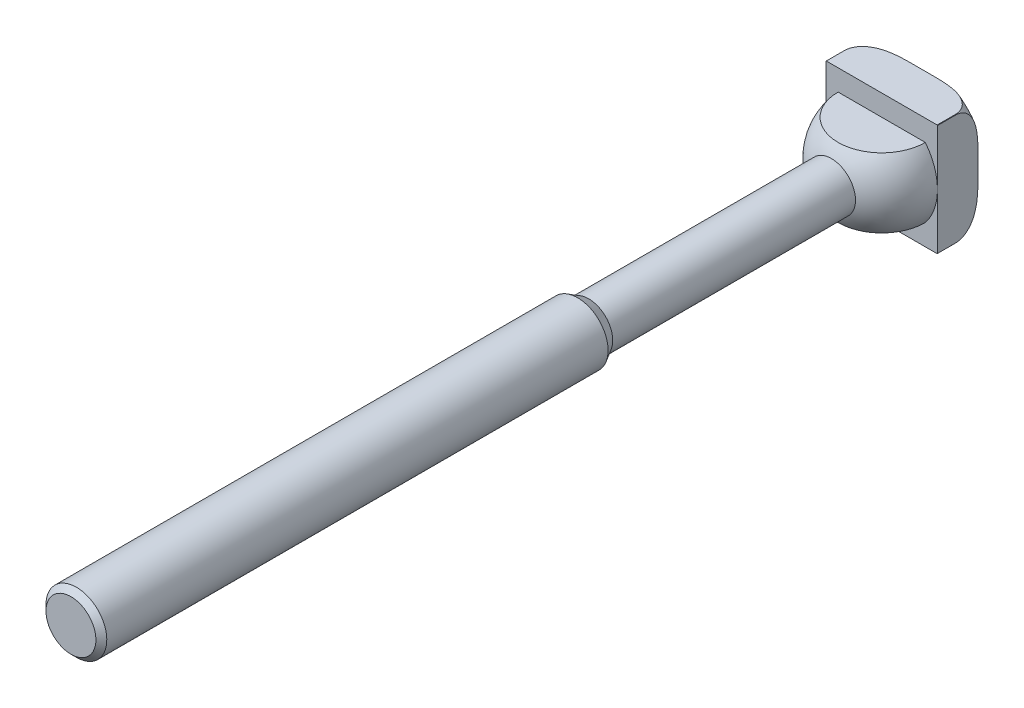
ISO-10303-21;
HEADER;
FILE_DESCRIPTION(('STEP AP214'),'2;1');
FILE_NAME('part.step','',(''),(''),'','','');
FILE_SCHEMA(('AUTOMOTIVE_DESIGN { 1 0 10303 214 1 1 1 1 }'));
ENDSEC;
DATA;
#1=APPLICATION_CONTEXT('core data for automotive mechanical design processes');
#2=APPLICATION_PROTOCOL_DEFINITION('international standard','automotive_design',2000,#1);
#3=PRODUCT_CONTEXT('',#1,'mechanical');
#4=PRODUCT('Part','Part','',(#3));
#5=PRODUCT_RELATED_PRODUCT_CATEGORY('part','',(#4));
#6=PRODUCT_DEFINITION_FORMATION('','',#4);
#7=PRODUCT_DEFINITION_CONTEXT('part definition',#1,'design');
#8=PRODUCT_DEFINITION('design','',#6,#7);
#9=PRODUCT_DEFINITION_SHAPE('','',#8);
#10=(LENGTH_UNIT() NAMED_UNIT(*) SI_UNIT(.MILLI.,.METRE.));
#11=(NAMED_UNIT(*) PLANE_ANGLE_UNIT() SI_UNIT($,.RADIAN.));
#12=(NAMED_UNIT(*) SI_UNIT($,.STERADIAN.) SOLID_ANGLE_UNIT());
#13=UNCERTAINTY_MEASURE_WITH_UNIT(LENGTH_MEASURE(1.E-05),#10,'distance_accuracy_value','');
#14=(GEOMETRIC_REPRESENTATION_CONTEXT(3) GLOBAL_UNCERTAINTY_ASSIGNED_CONTEXT((#13)) GLOBAL_UNIT_ASSIGNED_CONTEXT((#10,
#11,#12)) REPRESENTATION_CONTEXT('',''));
#15=CARTESIAN_POINT('',(0.,0.,0.));
#16=DIRECTION('',(0.,0.,1.));
#17=DIRECTION('',(1.,0.,0.));
#18=AXIS2_PLACEMENT_3D('',#15,#16,#17);
#19=CARTESIAN_POINT('',(0.,0.,-3.60000000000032));
#20=DIRECTION('',(0.,0.,-1.));
#21=DIRECTION('',(0.,-1.,0.));
#22=AXIS2_PLACEMENT_3D('',#19,#20,#21);
#23=TOROIDAL_SURFACE('',#22,11.1100000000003,4.39999999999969);
#24=CARTESIAN_POINT('',(-11.,0.,-7.9986247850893));
#25=CARTESIAN_POINT('',(-11.,-0.244167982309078,-7.99862566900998));
#26=CARTESIAN_POINT('',(-11.,-0.488335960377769,-7.99885116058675));
#27=CARTESIAN_POINT('',(-11.,-0.976671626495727,-7.99948190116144));
#28=CARTESIAN_POINT('',(-11.,-1.22083931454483,-7.9998871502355));
#29=CARTESIAN_POINT('',(-11.,-1.70936602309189,-8.00007526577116));
#30=CARTESIAN_POINT('',(-11.,-1.95372504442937,-7.99985764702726));
#31=CARTESIAN_POINT('',(-11.,-2.44244295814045,-7.99751713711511));
#32=CARTESIAN_POINT('',(-11.,-2.68680185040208,-7.9953942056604));
#33=CARTESIAN_POINT('',(-11.,-3.17540494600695,-7.98754889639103));
#34=CARTESIAN_POINT('',(-11.,-3.41964916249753,-7.98182749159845));
#35=CARTESIAN_POINT('',(-11.,-3.90794771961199,-7.96474581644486));
#36=CARTESIAN_POINT('',(-11.,-4.15200206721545,-7.95338576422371));
#37=CARTESIAN_POINT('',(-11.,-4.63930745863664,-7.92271306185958));
#38=CARTESIAN_POINT('',(-11.,-4.88255914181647,-7.90341115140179));
#39=CARTESIAN_POINT('',(-11.,-5.36808047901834,-7.85426911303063));
#40=CARTESIAN_POINT('',(-11.,-5.61034994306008,-7.82442703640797));
#41=CARTESIAN_POINT('',(-11.,-6.09743926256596,-7.75070651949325));
#42=CARTESIAN_POINT('',(-11.,-6.3422221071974,-7.70657606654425));
#43=CARTESIAN_POINT('',(-11.,-6.8280390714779,-7.60128676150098));
#44=CARTESIAN_POINT('',(-11.,-7.06907525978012,-7.54013768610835));
#45=CARTESIAN_POINT('',(-11.,-7.5440287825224,-7.39777029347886));
#46=CARTESIAN_POINT('',(-11.,-7.77797424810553,-7.31664763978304));
#47=CARTESIAN_POINT('',(-11.,-8.23621103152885,-7.13090753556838));
#48=CARTESIAN_POINT('',(-11.,-8.46051347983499,-7.02631808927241));
#49=CARTESIAN_POINT('',(-11.,-8.8893021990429,-6.79347114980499));
#50=CARTESIAN_POINT('',(-11.,-9.09414705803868,-6.66588219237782));
#51=CARTESIAN_POINT('',(-11.,-9.48435680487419,-6.38282448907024));
#52=CARTESIAN_POINT('',(-11.,-9.66970590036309,-6.22733341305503));
#53=CARTESIAN_POINT('',(-11.,-9.92764272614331,-5.97197598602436));
#54=CARTESIAN_POINT('',(-11.,-10.0107063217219,-5.8825714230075));
#55=CARTESIAN_POINT('',(-11.,-10.1684678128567,-5.69669341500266));
#56=CARTESIAN_POINT('',(-11.,-10.2431702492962,-5.60022385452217));
#57=CARTESIAN_POINT('',(-11.,-10.3828802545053,-5.40067661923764));
#58=CARTESIAN_POINT('',(-11.,-10.4479014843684,-5.29760855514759));
#59=CARTESIAN_POINT('',(-11.,-10.5670841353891,-5.08542919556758));
#60=CARTESIAN_POINT('',(-11.,-10.6212496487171,-4.97632019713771));
#61=CARTESIAN_POINT('',(-11.,-10.7405401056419,-4.69947224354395));
#62=CARTESIAN_POINT('',(-11.,-10.7985709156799,-4.52858953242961));
#63=CARTESIAN_POINT('',(-11.,-10.8850617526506,-4.17956065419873));
#64=CARTESIAN_POINT('',(-11.,-10.9135367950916,-4.00141822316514));
#65=CARTESIAN_POINT('',(-11.,-10.9392736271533,-3.64253555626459));
#66=CARTESIAN_POINT('',(-11.,-10.9364796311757,-3.46179125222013));
#67=CARTESIAN_POINT('',(-11.,-10.8997077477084,-3.1035156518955));
#68=CARTESIAN_POINT('',(-11.,-10.8657258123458,-2.92598477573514));
#69=CARTESIAN_POINT('',(-11.,-10.7697974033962,-2.58326250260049));
#70=CARTESIAN_POINT('',(-11.,-10.7085296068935,-2.41787879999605));
#71=CARTESIAN_POINT('',(-11.,-10.5614224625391,-2.09852829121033));
#72=CARTESIAN_POINT('',(-11.,-10.4755802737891,-1.9445628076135));
#73=CARTESIAN_POINT('',(-11.,-10.2740206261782,-1.63654089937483));
#74=CARTESIAN_POINT('',(-11.,-10.1562554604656,-1.48383203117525));
#75=CARTESIAN_POINT('',(-11.,-9.90072963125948,-1.19621722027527));
#76=CARTESIAN_POINT('',(-11.,-9.76295152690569,-1.06132700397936));
#77=CARTESIAN_POINT('',(-11.,-9.38652000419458,-0.735758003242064));
#78=CARTESIAN_POINT('',(-11.,-9.13606286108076,-0.558702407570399));
#79=CARTESIAN_POINT('',(-11.,-8.61050942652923,-0.246656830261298));
#80=CARTESIAN_POINT('',(-11.,-8.33537675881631,-0.111730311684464));
#81=CARTESIAN_POINT('',(-11.,-7.82006748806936,0.101266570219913));
#82=CARTESIAN_POINT('',(-11.,-7.58222898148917,0.185159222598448));
#83=CARTESIAN_POINT('',(-11.,-7.10003595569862,0.331865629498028));
#84=CARTESIAN_POINT('',(-11.,-6.85567647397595,0.394662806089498));
#85=CARTESIAN_POINT('',(-11.,-6.36219645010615,0.502824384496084));
#86=CARTESIAN_POINT('',(-11.,-6.11306070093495,0.54811758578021));
#87=CARTESIAN_POINT('',(-11.,-5.61276963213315,0.624275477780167));
#88=CARTESIAN_POINT('',(-11.,-5.36161522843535,0.655146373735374));
#89=CARTESIAN_POINT('',(-11.,-4.78187506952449,0.713294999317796));
#90=CARTESIAN_POINT('',(-11.,-4.45290899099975,0.736642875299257));
#91=CARTESIAN_POINT('',(-11.,-3.79428225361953,0.770498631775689));
#92=CARTESIAN_POINT('',(-11.,-3.46462137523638,0.781001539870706));
#93=CARTESIAN_POINT('',(-11.,-2.80475297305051,0.794523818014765));
#94=CARTESIAN_POINT('',(-11.,-2.47454529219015,0.797533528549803));
#95=CARTESIAN_POINT('',(-11.,-1.81418154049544,0.800324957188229));
#96=CARTESIAN_POINT('',(-11.,-1.48402546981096,0.800107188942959));
#97=CARTESIAN_POINT('',(-11.,-0.82393451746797,0.799332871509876));
#98=CARTESIAN_POINT('',(-11.,-0.493999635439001,0.798776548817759));
#99=CARTESIAN_POINT('',(-11.,0.165885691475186,0.798533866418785));
#100=CARTESIAN_POINT('',(-11.,0.495836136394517,0.798847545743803));
#101=CARTESIAN_POINT('',(-11.,1.15553605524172,0.79973197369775));
#102=CARTESIAN_POINT('',(-11.,1.48528553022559,0.800302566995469));
#103=CARTESIAN_POINT('',(-11.,2.1447765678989,0.799356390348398));
#104=CARTESIAN_POINT('',(-11.,2.47451813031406,0.797839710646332));
#105=CARTESIAN_POINT('',(-11.,3.04438053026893,0.790080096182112));
#106=CARTESIAN_POINT('',(-11.,3.28451680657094,0.785232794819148));
#107=CARTESIAN_POINT('',(-11.,3.76466882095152,0.770480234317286));
#108=CARTESIAN_POINT('',(-11.,4.00468454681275,0.760574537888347));
#109=CARTESIAN_POINT('',(-11.,4.48464487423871,0.733525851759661));
#110=CARTESIAN_POINT('',(-11.,4.72458897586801,0.716373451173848));
#111=CARTESIAN_POINT('',(-11.,5.20361397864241,0.672406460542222));
#112=CARTESIAN_POINT('',(-11.,5.44269491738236,0.645592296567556));
#113=CARTESIAN_POINT('',(-11.,5.92237388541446,0.579216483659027));
#114=CARTESIAN_POINT('',(-11.,6.16294979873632,0.539490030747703));
#115=CARTESIAN_POINT('',(-11.,6.64113749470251,0.444417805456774));
#116=CARTESIAN_POINT('',(-11.,6.87874845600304,0.389067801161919));
#117=CARTESIAN_POINT('',(-11.,7.34813652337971,0.259819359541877));
#118=CARTESIAN_POINT('',(-11.,7.57993016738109,0.185982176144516));
#119=CARTESIAN_POINT('',(-11.,8.0353842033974,0.0165125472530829));
#120=CARTESIAN_POINT('',(-11.,8.25904986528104,-0.0791054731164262));
#121=CARTESIAN_POINT('',(-11.,8.70040739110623,-0.298322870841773));
#122=CARTESIAN_POINT('',(-11.,8.91774655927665,-0.422642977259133));
#123=CARTESIAN_POINT('',(-11.,9.33339082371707,-0.700649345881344));
#124=CARTESIAN_POINT('',(-11.,9.53169018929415,-0.854344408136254));
#125=CARTESIAN_POINT('',(-11.,9.80930539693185,-1.10870064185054));
#126=CARTESIAN_POINT('',(-11.,9.89904640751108,-1.19810417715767));
#127=CARTESIAN_POINT('',(-11.,10.0700814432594,-1.38462017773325));
#128=CARTESIAN_POINT('',(-11.,10.1513803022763,-1.48172817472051));
#129=CARTESIAN_POINT('',(-11.,10.3040772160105,-1.68326064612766));
#130=CARTESIAN_POINT('',(-11.,10.3754890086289,-1.78767465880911));
#131=CARTESIAN_POINT('',(-11.,10.5070935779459,-2.00328733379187));
#132=CARTESIAN_POINT('',(-11.,10.5672911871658,-2.11448304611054));
#133=CARTESIAN_POINT('',(-11.,10.6985537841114,-2.39251409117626));
#134=CARTESIAN_POINT('',(-11.,10.76299986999,-2.56255583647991));
#135=CARTESIAN_POINT('',(-11.,10.862440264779,-2.91098018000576));
#136=CARTESIAN_POINT('',(-11.,10.8974518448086,-3.08935782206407));
#137=CARTESIAN_POINT('',(-11.,10.9360122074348,-3.44995476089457));
#138=CARTESIAN_POINT('',(-11.,10.9394870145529,-3.63218208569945));
#139=CARTESIAN_POINT('',(-11.,10.9145419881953,-3.99443117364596));
#140=CARTESIAN_POINT('',(-11.,10.8861197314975,-4.17445276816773));
#141=CARTESIAN_POINT('',(-11.,10.8006529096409,-4.52098257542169));
#142=CARTESIAN_POINT('',(-11.,10.7446134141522,-4.68774209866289));
#143=CARTESIAN_POINT('',(-11.,10.6074145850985,-5.01050120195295));
#144=CARTESIAN_POINT('',(-11.,10.5262513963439,-5.16649912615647));
#145=CARTESIAN_POINT('',(-11.,10.3348573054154,-5.47752748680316));
#146=CARTESIAN_POINT('',(-11.,10.2227798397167,-5.63141482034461));
#147=CARTESIAN_POINT('',(-11.,9.97826988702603,-5.92196783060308));
#148=CARTESIAN_POINT('',(-11.,9.84582459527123,-6.05862257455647));
#149=CARTESIAN_POINT('',(-11.,9.48633467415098,-6.38591323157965));
#150=CARTESIAN_POINT('',(-11.,9.24782164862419,-6.56397460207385));
#151=CARTESIAN_POINT('',(-11.,8.74555737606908,-6.87988293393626));
#152=CARTESIAN_POINT('',(-11.,8.48175205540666,-7.01764106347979));
#153=CARTESIAN_POINT('',(-11.,7.9912674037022,-7.23459728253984));
#154=CARTESIAN_POINT('',(-11.,7.76724215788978,-7.31996551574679));
#155=CARTESIAN_POINT('',(-11.,7.31248611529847,-7.47076953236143));
#156=CARTESIAN_POINT('',(-11.,7.08175056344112,-7.53619078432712));
#157=CARTESIAN_POINT('',(-11.,6.61580785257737,-7.65016374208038));
#158=CARTESIAN_POINT('',(-11.,6.38059348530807,-7.69868530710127));
#159=CARTESIAN_POINT('',(-11.,5.90765678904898,-7.78166493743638));
#160=CARTESIAN_POINT('',(-11.,5.66993347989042,-7.81611728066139));
#161=CARTESIAN_POINT('',(-11.,5.20678918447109,-7.87205097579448));
#162=CARTESIAN_POINT('',(-11.,4.98144154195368,-7.89416108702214));
#163=CARTESIAN_POINT('',(-11.,4.53016547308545,-7.93045973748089));
#164=CARTESIAN_POINT('',(-11.,4.30423713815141,-7.94464945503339));
#165=CARTESIAN_POINT('',(-11.,3.85190033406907,-7.96709033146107));
#166=CARTESIAN_POINT('',(-11.,3.62549161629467,-7.97533617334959));
#167=CARTESIAN_POINT('',(-11.,3.17256308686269,-7.98764124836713));
#168=CARTESIAN_POINT('',(-11.,2.94604327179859,-7.99170034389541));
#169=CARTESIAN_POINT('',(-11.,2.49282649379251,-7.99717570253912));
#170=CARTESIAN_POINT('',(-11.,2.26612951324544,-7.99859020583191));
#171=CARTESIAN_POINT('',(-11.,1.81273701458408,-8.00004599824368));
#172=CARTESIAN_POINT('',(-11.,1.58604149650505,-8.00008730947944));
#173=CARTESIAN_POINT('',(-11.,1.13278850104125,-7.99975527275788));
#174=CARTESIAN_POINT('',(-11.,0.906231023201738,-7.99938217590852));
#175=CARTESIAN_POINT('',(-11.,0.453115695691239,-7.99881652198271));
#176=CARTESIAN_POINT('',(-11.,0.226557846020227,-7.99862396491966));
#177=CARTESIAN_POINT('',(-11.,0.,-7.9986247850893));
#178=B_SPLINE_CURVE_WITH_KNOTS('',3,(#24,#25,#26,#27,#28,#29,#30,#31,#32,#33,#34,#35,#36,#37,
#38,#39,#40,#41,#42,#43,#44,#45,#46,#47,#48,#49,#50,#51,#52,#53,#54,#55,#56,#57,#58,#59,#60,#61,
#62,#63,#64,#65,#66,#67,#68,#69,#70,#71,#72,#73,#74,#75,#76,#77,#78,#79,#80,#81,#82,#83,#84,#85,
#86,#87,#88,#89,#90,#91,#92,#93,#94,#95,#96,#97,#98,#99,#100,#101,#102,#103,#104,#105,#106,#107,
#108,#109,#110,#111,#112,#113,#114,#115,#116,#117,#118,#119,#120,#121,#122,#123,#124,#125,#126,
#127,#128,#129,#130,#131,#132,#133,#134,#135,#136,#137,#138,#139,#140,#141,#142,#143,#144,#145,
#146,#147,#148,#149,#150,#151,#152,#153,#154,#155,#156,#157,#158,#159,#160,#161,#162,#163,#164,
#165,#166,#167,#168,#169,#170,#171,#172,#173,#174,#175,#176,#177),.UNSPECIFIED.,.T.,.F.,(4,2,2,
2,2,2,2,2,2,2,2,2,2,2,2,2,2,2,2,2,2,2,2,2,2,2,2,2,2,2,2,2,2,2,2,2,2,2,2,2,2,2,2,2,2,2,2,2,2,2,2,
2,2,2,2,2,2,2,2,2,2,2,2,2,2,2,2,2,2,2,2,2,2,2,2,2,4),(0.,0.732503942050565,1.46500819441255,
2.19808321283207,2.9311737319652,3.66406610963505,4.39693013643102,5.12880635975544,
5.86081796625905,6.60651638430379,7.35178730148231,8.09355590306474,8.83444397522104,
9.55651629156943,10.2791690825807,10.6448684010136,11.0103681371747,11.3753471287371,
11.7401882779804,12.279036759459,12.8176113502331,13.3571469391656,13.8967525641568,
14.423627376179,14.9505631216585,15.5269516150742,16.1038454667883,17.0187682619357,
17.9350627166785,18.6905663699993,19.446662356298,20.2058023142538,20.9646153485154,
21.9535833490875,22.9429340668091,23.933559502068,24.9240272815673,25.9138331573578,
26.9036834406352,27.8929360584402,28.8821459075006,29.602668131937,30.3232526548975,
31.0447758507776,31.7662672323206,32.4973547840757,33.2286405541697,33.9575346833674,
34.6859474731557,35.4351499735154,36.1845772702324,36.5641726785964,36.9435495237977,
37.3223938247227,37.7010744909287,38.2440729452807,38.7867525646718,39.3307048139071,
39.8746983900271,40.4002130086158,40.9258083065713,41.4947952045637,42.06414128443,
42.9520282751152,43.8418577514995,44.5600475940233,45.2787593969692,45.9987465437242,
46.7190262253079,47.3981425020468,48.0771577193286,48.7567795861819,49.4364237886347,
50.1165200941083,50.7966054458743,51.4762789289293,52.155952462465),.UNSPECIFIED.);
#179=CARTESIAN_POINT('',(-11.,-1.55951915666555,-8.));
#180=VERTEX_POINT('',#179);
#181=CARTESIAN_POINT('',(-11.,-10.9343541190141,-3.6));
#182=VERTEX_POINT('',#181);
#183=EDGE_CURVE('E262',#180,#182,#178,.T.);
#184=ORIENTED_EDGE('',*,*,#183,.F.);
#185=CARTESIAN_POINT('',(0.,0.,-8.));
#186=DIRECTION('',(0.,0.,-1.));
#187=DIRECTION('',(0.,-1.,0.));
#188=AXIS2_PLACEMENT_3D('',#185,#186,#187);
#189=CIRCLE('',#188,11.11);
#190=CARTESIAN_POINT('',(-1.55951915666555,-11.,-8.));
#191=VERTEX_POINT('',#190);
#192=EDGE_CURVE('E265',#191,#180,#189,.T.);
#193=ORIENTED_EDGE('',*,*,#192,.F.);
#194=CARTESIAN_POINT('',(0.,-11.,-7.9986247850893));
#195=CARTESIAN_POINT('',(0.244167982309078,-11.,-7.99862566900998));
#196=CARTESIAN_POINT('',(0.488335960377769,-11.,-7.99885116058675));
#197=CARTESIAN_POINT('',(0.976671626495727,-11.,-7.99948190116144));
#198=CARTESIAN_POINT('',(1.22083931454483,-11.,-7.9998871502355));
#199=CARTESIAN_POINT('',(1.70936602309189,-11.,-8.00007526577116));
#200=CARTESIAN_POINT('',(1.95372504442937,-11.,-7.99985764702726));
#201=CARTESIAN_POINT('',(2.44244295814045,-11.,-7.99751713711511));
#202=CARTESIAN_POINT('',(2.68680185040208,-11.,-7.9953942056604));
#203=CARTESIAN_POINT('',(3.17540494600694,-11.,-7.98754889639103));
#204=CARTESIAN_POINT('',(3.41964916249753,-11.,-7.98182749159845));
#205=CARTESIAN_POINT('',(3.90794771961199,-11.,-7.96474581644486));
#206=CARTESIAN_POINT('',(4.15200206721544,-11.,-7.95338576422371));
#207=CARTESIAN_POINT('',(4.63930745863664,-11.,-7.92271306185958));
#208=CARTESIAN_POINT('',(4.88255914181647,-11.,-7.90341115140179));
#209=CARTESIAN_POINT('',(5.36808047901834,-11.,-7.85426911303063));
#210=CARTESIAN_POINT('',(5.61034994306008,-11.,-7.82442703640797));
#211=CARTESIAN_POINT('',(6.09743926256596,-11.,-7.75070651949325));
#212=CARTESIAN_POINT('',(6.3422221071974,-11.,-7.70657606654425));
#213=CARTESIAN_POINT('',(6.8280390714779,-11.,-7.60128676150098));
#214=CARTESIAN_POINT('',(7.06907525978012,-11.,-7.54013768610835));
#215=CARTESIAN_POINT('',(7.5440287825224,-11.,-7.39777029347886));
#216=CARTESIAN_POINT('',(7.77797424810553,-11.,-7.31664763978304));
#217=CARTESIAN_POINT('',(8.23621103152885,-11.,-7.13090753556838));
#218=CARTESIAN_POINT('',(8.46051347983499,-11.,-7.02631808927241));
#219=CARTESIAN_POINT('',(8.8893021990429,-11.,-6.79347114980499));
#220=CARTESIAN_POINT('',(9.09414705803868,-11.,-6.66588219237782));
#221=CARTESIAN_POINT('',(9.48435680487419,-11.,-6.38282448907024));
#222=CARTESIAN_POINT('',(9.66970590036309,-11.,-6.22733341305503));
#223=CARTESIAN_POINT('',(9.92764272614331,-11.,-5.97197598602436));
#224=CARTESIAN_POINT('',(10.0107063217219,-11.,-5.8825714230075));
#225=CARTESIAN_POINT('',(10.1684678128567,-11.,-5.69669341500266));
#226=CARTESIAN_POINT('',(10.2431702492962,-11.,-5.60022385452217));
#227=CARTESIAN_POINT('',(10.3828802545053,-11.,-5.40067661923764));
#228=CARTESIAN_POINT('',(10.4479014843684,-11.,-5.29760855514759));
#229=CARTESIAN_POINT('',(10.5670841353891,-11.,-5.08542919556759));
#230=CARTESIAN_POINT('',(10.6212496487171,-11.,-4.97632019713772));
#231=CARTESIAN_POINT('',(10.7405401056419,-11.,-4.69947224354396));
#232=CARTESIAN_POINT('',(10.7985709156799,-11.,-4.52858953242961));
#233=CARTESIAN_POINT('',(10.8850617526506,-11.,-4.17956065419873));
#234=CARTESIAN_POINT('',(10.9135367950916,-11.,-4.00141822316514));
#235=CARTESIAN_POINT('',(10.9392736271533,-11.,-3.64253555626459));
#236=CARTESIAN_POINT('',(10.9364796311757,-11.,-3.46179125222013));
#237=CARTESIAN_POINT('',(10.8997077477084,-11.,-3.1035156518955));
#238=CARTESIAN_POINT('',(10.8657258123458,-11.,-2.92598477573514));
#239=CARTESIAN_POINT('',(10.7697974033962,-11.,-2.58326250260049));
#240=CARTESIAN_POINT('',(10.7085296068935,-11.,-2.41787879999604));
#241=CARTESIAN_POINT('',(10.5614224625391,-11.,-2.09852829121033));
#242=CARTESIAN_POINT('',(10.4755802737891,-11.,-1.9445628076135));
#243=CARTESIAN_POINT('',(10.2740206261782,-11.,-1.63654089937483));
#244=CARTESIAN_POINT('',(10.1562554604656,-11.,-1.48383203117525));
#245=CARTESIAN_POINT('',(9.90072963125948,-11.,-1.19621722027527));
#246=CARTESIAN_POINT('',(9.76295152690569,-11.,-1.06132700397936));
#247=CARTESIAN_POINT('',(9.38652000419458,-11.,-0.735758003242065));
#248=CARTESIAN_POINT('',(9.13606286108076,-11.,-0.558702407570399));
#249=CARTESIAN_POINT('',(8.61050942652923,-11.,-0.246656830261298));
#250=CARTESIAN_POINT('',(8.33537675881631,-11.,-0.111730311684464));
#251=CARTESIAN_POINT('',(7.82006748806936,-11.,0.101266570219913));
#252=CARTESIAN_POINT('',(7.58222898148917,-11.,0.185159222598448));
#253=CARTESIAN_POINT('',(7.10003595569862,-11.,0.331865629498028));
#254=CARTESIAN_POINT('',(6.85567647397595,-11.,0.394662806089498));
#255=CARTESIAN_POINT('',(6.36219645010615,-11.,0.502824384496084));
#256=CARTESIAN_POINT('',(6.11306070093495,-11.,0.54811758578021));
#257=CARTESIAN_POINT('',(5.61276963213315,-11.,0.624275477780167));
#258=CARTESIAN_POINT('',(5.36161522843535,-11.,0.655146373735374));
#259=CARTESIAN_POINT('',(4.78187506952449,-11.,0.713294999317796));
#260=CARTESIAN_POINT('',(4.45290899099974,-11.,0.736642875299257));
#261=CARTESIAN_POINT('',(3.79428225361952,-11.,0.770498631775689));
#262=CARTESIAN_POINT('',(3.46462137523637,-11.,0.781001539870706));
#263=CARTESIAN_POINT('',(2.8047529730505,-11.,0.794523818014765));
#264=CARTESIAN_POINT('',(2.47454529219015,-11.,0.797533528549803));
#265=CARTESIAN_POINT('',(1.81418154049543,-11.,0.800324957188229));
#266=CARTESIAN_POINT('',(1.48402546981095,-11.,0.800107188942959));
#267=CARTESIAN_POINT('',(0.823934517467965,-11.,0.799332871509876));
#268=CARTESIAN_POINT('',(0.493999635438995,-11.,0.798776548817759));
#269=CARTESIAN_POINT('',(-0.16588569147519,-11.,0.798533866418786));
#270=CARTESIAN_POINT('',(-0.49583613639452,-11.,0.798847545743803));
#271=CARTESIAN_POINT('',(-1.15553605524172,-11.,0.79973197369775));
#272=CARTESIAN_POINT('',(-1.4852855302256,-11.,0.800302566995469));
#273=CARTESIAN_POINT('',(-2.1447765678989,-11.,0.799356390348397));
#274=CARTESIAN_POINT('',(-2.47451813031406,-11.,0.797839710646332));
#275=CARTESIAN_POINT('',(-3.04438053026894,-11.,0.790080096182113));
#276=CARTESIAN_POINT('',(-3.28451680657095,-11.,0.785232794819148));
#277=CARTESIAN_POINT('',(-3.76466882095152,-11.,0.770480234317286));
#278=CARTESIAN_POINT('',(-4.00468454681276,-11.,0.760574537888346));
#279=CARTESIAN_POINT('',(-4.48464487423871,-11.,0.733525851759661));
#280=CARTESIAN_POINT('',(-4.72458897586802,-11.,0.716373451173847));
#281=CARTESIAN_POINT('',(-5.20361397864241,-11.,0.672406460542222));
#282=CARTESIAN_POINT('',(-5.44269491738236,-11.,0.645592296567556));
#283=CARTESIAN_POINT('',(-5.92237388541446,-11.,0.579216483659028));
#284=CARTESIAN_POINT('',(-6.16294979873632,-11.,0.539490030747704));
#285=CARTESIAN_POINT('',(-6.6411374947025,-11.,0.444417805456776));
#286=CARTESIAN_POINT('',(-6.87874845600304,-11.,0.38906780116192));
#287=CARTESIAN_POINT('',(-7.34813652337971,-11.,0.25981935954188));
#288=CARTESIAN_POINT('',(-7.57993016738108,-11.,0.185982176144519));
#289=CARTESIAN_POINT('',(-8.0353842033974,-11.,0.0165125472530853));
#290=CARTESIAN_POINT('',(-8.25904986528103,-11.,-0.0791054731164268));
#291=CARTESIAN_POINT('',(-8.70040739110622,-11.,-0.298322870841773));
#292=CARTESIAN_POINT('',(-8.91774655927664,-11.,-0.42264297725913));
#293=CARTESIAN_POINT('',(-9.33339082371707,-11.,-0.700649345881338));
#294=CARTESIAN_POINT('',(-9.53169018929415,-11.,-0.854344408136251));
#295=CARTESIAN_POINT('',(-9.80930539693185,-11.,-1.10870064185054));
#296=CARTESIAN_POINT('',(-9.89904640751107,-11.,-1.19810417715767));
#297=CARTESIAN_POINT('',(-10.0700814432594,-11.,-1.38462017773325));
#298=CARTESIAN_POINT('',(-10.1513803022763,-11.,-1.48172817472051));
#299=CARTESIAN_POINT('',(-10.3040772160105,-11.,-1.68326064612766));
#300=CARTESIAN_POINT('',(-10.3754890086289,-11.,-1.78767465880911));
#301=CARTESIAN_POINT('',(-10.5070935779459,-11.,-2.00328733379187));
#302=CARTESIAN_POINT('',(-10.5672911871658,-11.,-2.11448304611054));
#303=CARTESIAN_POINT('',(-10.6985537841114,-11.,-2.39251409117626));
#304=CARTESIAN_POINT('',(-10.76299986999,-11.,-2.56255583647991));
#305=CARTESIAN_POINT('',(-10.862440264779,-11.,-2.91098018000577));
#306=CARTESIAN_POINT('',(-10.8974518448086,-11.,-3.08935782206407));
#307=CARTESIAN_POINT('',(-10.9360122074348,-11.,-3.44995476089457));
#308=CARTESIAN_POINT('',(-10.9394870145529,-11.,-3.63218208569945));
#309=CARTESIAN_POINT('',(-10.9145419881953,-11.,-3.99443117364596));
#310=CARTESIAN_POINT('',(-10.8861197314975,-11.,-4.17445276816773));
#311=CARTESIAN_POINT('',(-10.8006529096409,-11.,-4.52098257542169));
#312=CARTESIAN_POINT('',(-10.7446134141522,-11.,-4.68774209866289));
#313=CARTESIAN_POINT('',(-10.6074145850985,-11.,-5.01050120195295));
#314=CARTESIAN_POINT('',(-10.5262513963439,-11.,-5.16649912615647));
#315=CARTESIAN_POINT('',(-10.3348573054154,-11.,-5.47752748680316));
#316=CARTESIAN_POINT('',(-10.2227798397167,-11.,-5.63141482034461));
#317=CARTESIAN_POINT('',(-9.97826988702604,-11.,-5.92196783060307));
#318=CARTESIAN_POINT('',(-9.84582459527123,-11.,-6.05862257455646));
#319=CARTESIAN_POINT('',(-9.48633467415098,-11.,-6.38591323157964));
#320=CARTESIAN_POINT('',(-9.24782164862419,-11.,-6.56397460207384));
#321=CARTESIAN_POINT('',(-8.74555737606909,-11.,-6.87988293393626));
#322=CARTESIAN_POINT('',(-8.48175205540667,-11.,-7.0176410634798));
#323=CARTESIAN_POINT('',(-7.99126740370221,-11.,-7.23459728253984));
#324=CARTESIAN_POINT('',(-7.76724215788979,-11.,-7.31996551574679));
#325=CARTESIAN_POINT('',(-7.31248611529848,-11.,-7.47076953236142));
#326=CARTESIAN_POINT('',(-7.08175056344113,-11.,-7.53619078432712));
#327=CARTESIAN_POINT('',(-6.61580785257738,-11.,-7.65016374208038));
#328=CARTESIAN_POINT('',(-6.38059348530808,-11.,-7.69868530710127));
#329=CARTESIAN_POINT('',(-5.90765678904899,-11.,-7.78166493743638));
#330=CARTESIAN_POINT('',(-5.66993347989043,-11.,-7.81611728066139));
#331=CARTESIAN_POINT('',(-5.2067891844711,-11.,-7.87205097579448));
#332=CARTESIAN_POINT('',(-4.9814415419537,-11.,-7.89416108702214));
#333=CARTESIAN_POINT('',(-4.53016547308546,-11.,-7.93045973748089));
#334=CARTESIAN_POINT('',(-4.30423713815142,-11.,-7.94464945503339));
#335=CARTESIAN_POINT('',(-3.85190033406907,-11.,-7.96709033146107));
#336=CARTESIAN_POINT('',(-3.62549161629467,-11.,-7.97533617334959));
#337=CARTESIAN_POINT('',(-3.17256308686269,-11.,-7.98764124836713));
#338=CARTESIAN_POINT('',(-2.94604327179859,-11.,-7.99170034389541));
#339=CARTESIAN_POINT('',(-2.49282649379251,-11.,-7.99717570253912));
#340=CARTESIAN_POINT('',(-2.26612951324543,-11.,-7.99859020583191));
#341=CARTESIAN_POINT('',(-1.81273701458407,-11.,-8.00004599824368));
#342=CARTESIAN_POINT('',(-1.58604149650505,-11.,-8.00008730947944));
#343=CARTESIAN_POINT('',(-1.13278850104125,-11.,-7.99975527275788));
#344=CARTESIAN_POINT('',(-0.906231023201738,-11.,-7.99938217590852));
#345=CARTESIAN_POINT('',(-0.45311569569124,-11.,-7.99881652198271));
#346=CARTESIAN_POINT('',(-0.226557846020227,-11.,-7.99862396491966));
#347=CARTESIAN_POINT('',(0.,-11.,-7.9986247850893));
#348=B_SPLINE_CURVE_WITH_KNOTS('',3,(#194,#195,#196,#197,#198,#199,#200,#201,#202,#203,#204,
#205,#206,#207,#208,#209,#210,#211,#212,#213,#214,#215,#216,#217,#218,#219,#220,#221,#222,#223,
#224,#225,#226,#227,#228,#229,#230,#231,#232,#233,#234,#235,#236,#237,#238,#239,#240,#241,#242,
#243,#244,#245,#246,#247,#248,#249,#250,#251,#252,#253,#254,#255,#256,#257,#258,#259,#260,#261,
#262,#263,#264,#265,#266,#267,#268,#269,#270,#271,#272,#273,#274,#275,#276,#277,#278,#279,#280,
#281,#282,#283,#284,#285,#286,#287,#288,#289,#290,#291,#292,#293,#294,#295,#296,#297,#298,#299,
#300,#301,#302,#303,#304,#305,#306,#307,#308,#309,#310,#311,#312,#313,#314,#315,#316,#317,#318,
#319,#320,#321,#322,#323,#324,#325,#326,#327,#328,#329,#330,#331,#332,#333,#334,#335,#336,#337,
#338,#339,#340,#341,#342,#343,#344,#345,#346,#347),.UNSPECIFIED.,.T.,.F.,(4,2,2,2,2,2,2,2,2,2,2,
2,2,2,2,2,2,2,2,2,2,2,2,2,2,2,2,2,2,2,2,2,2,2,2,2,2,2,2,2,2,2,2,2,2,2,2,2,2,2,2,2,2,2,2,2,2,2,2,
2,2,2,2,2,2,2,2,2,2,2,2,2,2,2,2,2,4),(0.,0.732503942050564,1.46500819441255,2.19808321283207,
2.9311737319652,3.66406610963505,4.39693013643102,5.12880635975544,5.86081796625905,
6.60651638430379,7.35178730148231,8.09355590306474,8.83444397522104,9.55651629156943,
10.2791690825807,10.6448684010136,11.0103681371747,11.3753471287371,11.7401882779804,
12.279036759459,12.8176113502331,13.3571469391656,13.8967525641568,14.423627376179,
14.9505631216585,15.5269516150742,16.1038454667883,17.0187682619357,17.9350627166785,
18.6905663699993,19.446662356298,20.2058023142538,20.9646153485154,21.9535833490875,
22.9429340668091,23.933559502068,24.9240272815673,25.9138331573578,26.9036834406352,
27.8929360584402,28.8821459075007,29.602668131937,30.3232526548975,31.0447758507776,
31.7662672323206,32.4973547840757,33.2286405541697,33.9575346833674,34.6859474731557,
35.4351499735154,36.1845772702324,36.5641726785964,36.9435495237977,37.3223938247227,
37.7010744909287,38.2440729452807,38.7867525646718,39.3307048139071,39.8746983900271,
40.4002130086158,40.9258083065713,41.4947952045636,42.06414128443,42.9520282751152,
43.8418577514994,44.5600475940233,45.2787593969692,45.9987465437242,46.7190262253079,
47.3981425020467,48.0771577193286,48.7567795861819,49.4364237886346,50.1165200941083,
50.7966054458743,51.4762789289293,52.155952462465),.UNSPECIFIED.);
#349=CARTESIAN_POINT('',(-10.9343541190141,-11.,-3.6));
#350=VERTEX_POINT('',#349);
#351=EDGE_CURVE('E308',#350,#191,#348,.T.);
#352=ORIENTED_EDGE('',*,*,#351,.F.);
#353=CARTESIAN_POINT('',(0.,0.,-3.6));
#354=DIRECTION('',(0.,0.,-1.));
#355=DIRECTION('',(0.,-1.,0.));
#356=AXIS2_PLACEMENT_3D('',#353,#354,#355);
#357=CIRCLE('',#356,15.51);
#358=EDGE_CURVE('E167',#350,#182,#357,.T.);
#359=ORIENTED_EDGE('',*,*,#358,.T.);
#360=EDGE_LOOP('',(#184,#193,#352,#359));
#361=FACE_BOUND('',#360,.T.);
#362=ADVANCED_FACE('F14',(#361),#23,.T.);
#363=CARTESIAN_POINT('',(-11.,10.9343541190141,-3.6));
#364=VERTEX_POINT('',#363);
#365=CARTESIAN_POINT('',(-11.,1.55951915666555,-8.));
#366=VERTEX_POINT('',#365);
#367=EDGE_CURVE('E269',#364,#366,#178,.T.);
#368=ORIENTED_EDGE('',*,*,#367,.F.);
#369=CARTESIAN_POINT('',(-10.9343541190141,11.,-3.6));
#370=VERTEX_POINT('',#369);
#371=EDGE_CURVE('E288',#364,#370,#357,.T.);
#372=ORIENTED_EDGE('',*,*,#371,.T.);
#373=CARTESIAN_POINT('',(0.,11.,-7.9986247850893));
#374=CARTESIAN_POINT('',(-0.244167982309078,11.,-7.99862566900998));
#375=CARTESIAN_POINT('',(-0.488335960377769,11.,-7.99885116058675));
#376=CARTESIAN_POINT('',(-0.976671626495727,11.,-7.99948190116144));
#377=CARTESIAN_POINT('',(-1.22083931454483,11.,-7.9998871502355));
#378=CARTESIAN_POINT('',(-1.70936602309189,11.,-8.00007526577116));
#379=CARTESIAN_POINT('',(-1.95372504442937,11.,-7.99985764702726));
#380=CARTESIAN_POINT('',(-2.44244295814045,11.,-7.99751713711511));
#381=CARTESIAN_POINT('',(-2.68680185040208,11.,-7.9953942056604));
#382=CARTESIAN_POINT('',(-3.17540494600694,11.,-7.98754889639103));
#383=CARTESIAN_POINT('',(-3.41964916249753,11.,-7.98182749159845));
#384=CARTESIAN_POINT('',(-3.90794771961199,11.,-7.96474581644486));
#385=CARTESIAN_POINT('',(-4.15200206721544,11.,-7.95338576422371));
#386=CARTESIAN_POINT('',(-4.63930745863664,11.,-7.92271306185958));
#387=CARTESIAN_POINT('',(-4.88255914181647,11.,-7.90341115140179));
#388=CARTESIAN_POINT('',(-5.36808047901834,11.,-7.85426911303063));
#389=CARTESIAN_POINT('',(-5.61034994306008,11.,-7.82442703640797));
#390=CARTESIAN_POINT('',(-6.09743926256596,11.,-7.75070651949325));
#391=CARTESIAN_POINT('',(-6.3422221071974,11.,-7.70657606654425));
#392=CARTESIAN_POINT('',(-6.8280390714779,11.,-7.60128676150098));
#393=CARTESIAN_POINT('',(-7.06907525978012,11.,-7.54013768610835));
#394=CARTESIAN_POINT('',(-7.5440287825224,11.,-7.39777029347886));
#395=CARTESIAN_POINT('',(-7.77797424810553,11.,-7.31664763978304));
#396=CARTESIAN_POINT('',(-8.23621103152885,11.,-7.13090753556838));
#397=CARTESIAN_POINT('',(-8.46051347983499,11.,-7.02631808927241));
#398=CARTESIAN_POINT('',(-8.8893021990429,11.,-6.79347114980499));
#399=CARTESIAN_POINT('',(-9.09414705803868,11.,-6.66588219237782));
#400=CARTESIAN_POINT('',(-9.48435680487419,11.,-6.38282448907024));
#401=CARTESIAN_POINT('',(-9.66970590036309,11.,-6.22733341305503));
#402=CARTESIAN_POINT('',(-9.92764272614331,11.,-5.97197598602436));
#403=CARTESIAN_POINT('',(-10.0107063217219,11.,-5.8825714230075));
#404=CARTESIAN_POINT('',(-10.1684678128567,11.,-5.69669341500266));
#405=CARTESIAN_POINT('',(-10.2431702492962,11.,-5.60022385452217));
#406=CARTESIAN_POINT('',(-10.3828802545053,11.,-5.40067661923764));
#407=CARTESIAN_POINT('',(-10.4479014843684,11.,-5.29760855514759));
#408=CARTESIAN_POINT('',(-10.5670841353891,11.,-5.08542919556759));
#409=CARTESIAN_POINT('',(-10.6212496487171,11.,-4.97632019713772));
#410=CARTESIAN_POINT('',(-10.7405401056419,11.,-4.69947224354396));
#411=CARTESIAN_POINT('',(-10.7985709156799,11.,-4.52858953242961));
#412=CARTESIAN_POINT('',(-10.8850617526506,11.,-4.17956065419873));
#413=CARTESIAN_POINT('',(-10.9135367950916,11.,-4.00141822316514));
#414=CARTESIAN_POINT('',(-10.9392736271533,11.,-3.64253555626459));
#415=CARTESIAN_POINT('',(-10.9364796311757,11.,-3.46179125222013));
#416=CARTESIAN_POINT('',(-10.8997077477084,11.,-3.1035156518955));
#417=CARTESIAN_POINT('',(-10.8657258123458,11.,-2.92598477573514));
#418=CARTESIAN_POINT('',(-10.7697974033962,11.,-2.58326250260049));
#419=CARTESIAN_POINT('',(-10.7085296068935,11.,-2.41787879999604));
#420=CARTESIAN_POINT('',(-10.5614224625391,11.,-2.09852829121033));
#421=CARTESIAN_POINT('',(-10.4755802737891,11.,-1.9445628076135));
#422=CARTESIAN_POINT('',(-10.2740206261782,11.,-1.63654089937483));
#423=CARTESIAN_POINT('',(-10.1562554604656,11.,-1.48383203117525));
#424=CARTESIAN_POINT('',(-9.90072963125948,11.,-1.19621722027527));
#425=CARTESIAN_POINT('',(-9.76295152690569,11.,-1.06132700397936));
#426=CARTESIAN_POINT('',(-9.38652000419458,11.,-0.735758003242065));
#427=CARTESIAN_POINT('',(-9.13606286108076,11.,-0.558702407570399));
#428=CARTESIAN_POINT('',(-8.61050942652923,11.,-0.246656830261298));
#429=CARTESIAN_POINT('',(-8.33537675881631,11.,-0.111730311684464));
#430=CARTESIAN_POINT('',(-7.82006748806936,11.,0.101266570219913));
#431=CARTESIAN_POINT('',(-7.58222898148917,11.,0.185159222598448));
#432=CARTESIAN_POINT('',(-7.10003595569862,11.,0.331865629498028));
#433=CARTESIAN_POINT('',(-6.85567647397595,11.,0.394662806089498));
#434=CARTESIAN_POINT('',(-6.36219645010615,11.,0.502824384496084));
#435=CARTESIAN_POINT('',(-6.11306070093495,11.,0.54811758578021));
#436=CARTESIAN_POINT('',(-5.61276963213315,11.,0.624275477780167));
#437=CARTESIAN_POINT('',(-5.36161522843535,11.,0.655146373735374));
#438=CARTESIAN_POINT('',(-4.78187506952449,11.,0.713294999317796));
#439=CARTESIAN_POINT('',(-4.45290899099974,11.,0.736642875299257));
#440=CARTESIAN_POINT('',(-3.79428225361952,11.,0.770498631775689));
#441=CARTESIAN_POINT('',(-3.46462137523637,11.,0.781001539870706));
#442=CARTESIAN_POINT('',(-2.8047529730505,11.,0.794523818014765));
#443=CARTESIAN_POINT('',(-2.47454529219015,11.,0.797533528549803));
#444=CARTESIAN_POINT('',(-1.81418154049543,11.,0.800324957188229));
#445=CARTESIAN_POINT('',(-1.48402546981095,11.,0.800107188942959));
#446=CARTESIAN_POINT('',(-0.823934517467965,11.,0.799332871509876));
#447=CARTESIAN_POINT('',(-0.493999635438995,11.,0.798776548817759));
#448=CARTESIAN_POINT('',(0.16588569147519,11.,0.798533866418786));
#449=CARTESIAN_POINT('',(0.49583613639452,11.,0.798847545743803));
#450=CARTESIAN_POINT('',(1.15553605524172,11.,0.79973197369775));
#451=CARTESIAN_POINT('',(1.4852855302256,11.,0.800302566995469));
#452=CARTESIAN_POINT('',(2.1447765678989,11.,0.799356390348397));
#453=CARTESIAN_POINT('',(2.47451813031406,11.,0.797839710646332));
#454=CARTESIAN_POINT('',(3.04438053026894,11.,0.790080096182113));
#455=CARTESIAN_POINT('',(3.28451680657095,11.,0.785232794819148));
#456=CARTESIAN_POINT('',(3.76466882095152,11.,0.770480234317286));
#457=CARTESIAN_POINT('',(4.00468454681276,11.,0.760574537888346));
#458=CARTESIAN_POINT('',(4.48464487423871,11.,0.733525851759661));
#459=CARTESIAN_POINT('',(4.72458897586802,11.,0.716373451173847));
#460=CARTESIAN_POINT('',(5.20361397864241,11.,0.672406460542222));
#461=CARTESIAN_POINT('',(5.44269491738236,11.,0.645592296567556));
#462=CARTESIAN_POINT('',(5.92237388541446,11.,0.579216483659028));
#463=CARTESIAN_POINT('',(6.16294979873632,11.,0.539490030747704));
#464=CARTESIAN_POINT('',(6.6411374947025,11.,0.444417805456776));
#465=CARTESIAN_POINT('',(6.87874845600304,11.,0.38906780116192));
#466=CARTESIAN_POINT('',(7.34813652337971,11.,0.25981935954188));
#467=CARTESIAN_POINT('',(7.57993016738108,11.,0.185982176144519));
#468=CARTESIAN_POINT('',(8.0353842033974,11.,0.0165125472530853));
#469=CARTESIAN_POINT('',(8.25904986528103,11.,-0.0791054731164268));
#470=CARTESIAN_POINT('',(8.70040739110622,11.,-0.298322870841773));
#471=CARTESIAN_POINT('',(8.91774655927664,11.,-0.42264297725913));
#472=CARTESIAN_POINT('',(9.33339082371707,11.,-0.700649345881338));
#473=CARTESIAN_POINT('',(9.53169018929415,11.,-0.854344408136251));
#474=CARTESIAN_POINT('',(9.80930539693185,11.,-1.10870064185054));
#475=CARTESIAN_POINT('',(9.89904640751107,11.,-1.19810417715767));
#476=CARTESIAN_POINT('',(10.0700814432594,11.,-1.38462017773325));
#477=CARTESIAN_POINT('',(10.1513803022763,11.,-1.48172817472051));
#478=CARTESIAN_POINT('',(10.3040772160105,11.,-1.68326064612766));
#479=CARTESIAN_POINT('',(10.3754890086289,11.,-1.78767465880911));
#480=CARTESIAN_POINT('',(10.5070935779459,11.,-2.00328733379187));
#481=CARTESIAN_POINT('',(10.5672911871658,11.,-2.11448304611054));
#482=CARTESIAN_POINT('',(10.6985537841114,11.,-2.39251409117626));
#483=CARTESIAN_POINT('',(10.76299986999,11.,-2.56255583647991));
#484=CARTESIAN_POINT('',(10.862440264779,11.,-2.91098018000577));
#485=CARTESIAN_POINT('',(10.8974518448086,11.,-3.08935782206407));
#486=CARTESIAN_POINT('',(10.9360122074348,11.,-3.44995476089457));
#487=CARTESIAN_POINT('',(10.9394870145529,11.,-3.63218208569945));
#488=CARTESIAN_POINT('',(10.9145419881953,11.,-3.99443117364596));
#489=CARTESIAN_POINT('',(10.8861197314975,11.,-4.17445276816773));
#490=CARTESIAN_POINT('',(10.8006529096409,11.,-4.52098257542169));
#491=CARTESIAN_POINT('',(10.7446134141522,11.,-4.68774209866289));
#492=CARTESIAN_POINT('',(10.6074145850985,11.,-5.01050120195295));
#493=CARTESIAN_POINT('',(10.5262513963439,11.,-5.16649912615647));
#494=CARTESIAN_POINT('',(10.3348573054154,11.,-5.47752748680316));
#495=CARTESIAN_POINT('',(10.2227798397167,11.,-5.63141482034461));
#496=CARTESIAN_POINT('',(9.97826988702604,11.,-5.92196783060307));
#497=CARTESIAN_POINT('',(9.84582459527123,11.,-6.05862257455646));
#498=CARTESIAN_POINT('',(9.48633467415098,11.,-6.38591323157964));
#499=CARTESIAN_POINT('',(9.24782164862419,11.,-6.56397460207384));
#500=CARTESIAN_POINT('',(8.74555737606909,11.,-6.87988293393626));
#501=CARTESIAN_POINT('',(8.48175205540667,11.,-7.0176410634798));
#502=CARTESIAN_POINT('',(7.99126740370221,11.,-7.23459728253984));
#503=CARTESIAN_POINT('',(7.76724215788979,11.,-7.31996551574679));
#504=CARTESIAN_POINT('',(7.31248611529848,11.,-7.47076953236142));
#505=CARTESIAN_POINT('',(7.08175056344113,11.,-7.53619078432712));
#506=CARTESIAN_POINT('',(6.61580785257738,11.,-7.65016374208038));
#507=CARTESIAN_POINT('',(6.38059348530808,11.,-7.69868530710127));
#508=CARTESIAN_POINT('',(5.90765678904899,11.,-7.78166493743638));
#509=CARTESIAN_POINT('',(5.66993347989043,11.,-7.81611728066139));
#510=CARTESIAN_POINT('',(5.2067891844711,11.,-7.87205097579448));
#511=CARTESIAN_POINT('',(4.9814415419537,11.,-7.89416108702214));
#512=CARTESIAN_POINT('',(4.53016547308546,11.,-7.93045973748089));
#513=CARTESIAN_POINT('',(4.30423713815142,11.,-7.94464945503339));
#514=CARTESIAN_POINT('',(3.85190033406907,11.,-7.96709033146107));
#515=CARTESIAN_POINT('',(3.62549161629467,11.,-7.97533617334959));
#516=CARTESIAN_POINT('',(3.17256308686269,11.,-7.98764124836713));
#517=CARTESIAN_POINT('',(2.94604327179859,11.,-7.99170034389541));
#518=CARTESIAN_POINT('',(2.49282649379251,11.,-7.99717570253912));
#519=CARTESIAN_POINT('',(2.26612951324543,11.,-7.99859020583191));
#520=CARTESIAN_POINT('',(1.81273701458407,11.,-8.00004599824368));
#521=CARTESIAN_POINT('',(1.58604149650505,11.,-8.00008730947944));
#522=CARTESIAN_POINT('',(1.13278850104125,11.,-7.99975527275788));
#523=CARTESIAN_POINT('',(0.906231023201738,11.,-7.99938217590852));
#524=CARTESIAN_POINT('',(0.45311569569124,11.,-7.99881652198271));
#525=CARTESIAN_POINT('',(0.226557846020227,11.,-7.99862396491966));
#526=CARTESIAN_POINT('',(0.,11.,-7.9986247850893));
#527=B_SPLINE_CURVE_WITH_KNOTS('',3,(#373,#374,#375,#376,#377,#378,#379,#380,#381,#382,#383,
#384,#385,#386,#387,#388,#389,#390,#391,#392,#393,#394,#395,#396,#397,#398,#399,#400,#401,#402,
#403,#404,#405,#406,#407,#408,#409,#410,#411,#412,#413,#414,#415,#416,#417,#418,#419,#420,#421,
#422,#423,#424,#425,#426,#427,#428,#429,#430,#431,#432,#433,#434,#435,#436,#437,#438,#439,#440,
#441,#442,#443,#444,#445,#446,#447,#448,#449,#450,#451,#452,#453,#454,#455,#456,#457,#458,#459,
#460,#461,#462,#463,#464,#465,#466,#467,#468,#469,#470,#471,#472,#473,#474,#475,#476,#477,#478,
#479,#480,#481,#482,#483,#484,#485,#486,#487,#488,#489,#490,#491,#492,#493,#494,#495,#496,#497,
#498,#499,#500,#501,#502,#503,#504,#505,#506,#507,#508,#509,#510,#511,#512,#513,#514,#515,#516,
#517,#518,#519,#520,#521,#522,#523,#524,#525,#526),.UNSPECIFIED.,.T.,.F.,(4,2,2,2,2,2,2,2,2,2,2,
2,2,2,2,2,2,2,2,2,2,2,2,2,2,2,2,2,2,2,2,2,2,2,2,2,2,2,2,2,2,2,2,2,2,2,2,2,2,2,2,2,2,2,2,2,2,2,2,
2,2,2,2,2,2,2,2,2,2,2,2,2,2,2,2,2,4),(0.,0.732503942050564,1.46500819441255,2.19808321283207,
2.9311737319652,3.66406610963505,4.39693013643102,5.12880635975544,5.86081796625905,
6.60651638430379,7.35178730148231,8.09355590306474,8.83444397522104,9.55651629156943,
10.2791690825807,10.6448684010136,11.0103681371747,11.3753471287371,11.7401882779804,
12.279036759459,12.8176113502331,13.3571469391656,13.8967525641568,14.423627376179,
14.9505631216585,15.5269516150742,16.1038454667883,17.0187682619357,17.9350627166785,
18.6905663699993,19.446662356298,20.2058023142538,20.9646153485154,21.9535833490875,
22.9429340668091,23.933559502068,24.9240272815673,25.9138331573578,26.9036834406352,
27.8929360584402,28.8821459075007,29.602668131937,30.3232526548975,31.0447758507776,
31.7662672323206,32.4973547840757,33.2286405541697,33.9575346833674,34.6859474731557,
35.4351499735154,36.1845772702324,36.5641726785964,36.9435495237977,37.3223938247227,
37.7010744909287,38.2440729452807,38.7867525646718,39.3307048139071,39.8746983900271,
40.4002130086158,40.9258083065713,41.4947952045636,42.06414128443,42.9520282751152,
43.8418577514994,44.5600475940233,45.2787593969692,45.9987465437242,46.7190262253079,
47.3981425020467,48.0771577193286,48.7567795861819,49.4364237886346,50.1165200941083,
50.7966054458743,51.4762789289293,52.155952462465),.UNSPECIFIED.);
#528=CARTESIAN_POINT('',(-1.55951915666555,11.,-8.));
#529=VERTEX_POINT('',#528);
#530=EDGE_CURVE('E190',#529,#370,#527,.T.);
#531=ORIENTED_EDGE('',*,*,#530,.F.);
#532=EDGE_CURVE('E280',#366,#529,#189,.T.);
#533=ORIENTED_EDGE('',*,*,#532,.F.);
#534=EDGE_LOOP('',(#368,#372,#531,#533));
#535=FACE_BOUND('',#534,.T.);
#536=ADVANCED_FACE('F253',(#535),#23,.T.);
#537=CARTESIAN_POINT('',(10.9343541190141,11.,-3.6));
#538=VERTEX_POINT('',#537);
#539=CARTESIAN_POINT('',(1.55951915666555,11.,-8.));
#540=VERTEX_POINT('',#539);
#541=EDGE_CURVE('E191',#538,#540,#527,.T.);
#542=ORIENTED_EDGE('',*,*,#541,.F.);
#543=CARTESIAN_POINT('',(11.,10.9343541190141,-3.6));
#544=VERTEX_POINT('',#543);
#545=EDGE_CURVE('E166',#538,#544,#357,.T.);
#546=ORIENTED_EDGE('',*,*,#545,.T.);
#547=CARTESIAN_POINT('',(11.,0.,-7.9986247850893));
#548=CARTESIAN_POINT('',(11.,0.244167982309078,-7.99862566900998));
#549=CARTESIAN_POINT('',(11.,0.488335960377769,-7.99885116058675));
#550=CARTESIAN_POINT('',(11.,0.976671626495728,-7.99948190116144));
#551=CARTESIAN_POINT('',(11.,1.22083931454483,-7.9998871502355));
#552=CARTESIAN_POINT('',(11.,1.70936602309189,-8.00007526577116));
#553=CARTESIAN_POINT('',(11.,1.95372504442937,-7.99985764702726));
#554=CARTESIAN_POINT('',(11.,2.44244295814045,-7.99751713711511));
#555=CARTESIAN_POINT('',(11.,2.68680185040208,-7.9953942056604));
#556=CARTESIAN_POINT('',(11.,3.17540494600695,-7.98754889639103));
#557=CARTESIAN_POINT('',(11.,3.41964916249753,-7.98182749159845));
#558=CARTESIAN_POINT('',(11.,3.90794771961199,-7.96474581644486));
#559=CARTESIAN_POINT('',(11.,4.15200206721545,-7.95338576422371));
#560=CARTESIAN_POINT('',(11.,4.63930745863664,-7.92271306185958));
#561=CARTESIAN_POINT('',(11.,4.88255914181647,-7.90341115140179));
#562=CARTESIAN_POINT('',(11.,5.36808047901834,-7.85426911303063));
#563=CARTESIAN_POINT('',(11.,5.61034994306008,-7.82442703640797));
#564=CARTESIAN_POINT('',(11.,6.09743926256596,-7.75070651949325));
#565=CARTESIAN_POINT('',(11.,6.3422221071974,-7.70657606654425));
#566=CARTESIAN_POINT('',(11.,6.8280390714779,-7.60128676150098));
#567=CARTESIAN_POINT('',(11.,7.06907525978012,-7.54013768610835));
#568=CARTESIAN_POINT('',(11.,7.5440287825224,-7.39777029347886));
#569=CARTESIAN_POINT('',(11.,7.77797424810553,-7.31664763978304));
#570=CARTESIAN_POINT('',(11.,8.23621103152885,-7.13090753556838));
#571=CARTESIAN_POINT('',(11.,8.46051347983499,-7.02631808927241));
#572=CARTESIAN_POINT('',(11.,8.8893021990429,-6.79347114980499));
#573=CARTESIAN_POINT('',(11.,9.09414705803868,-6.66588219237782));
#574=CARTESIAN_POINT('',(11.,9.48435680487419,-6.38282448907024));
#575=CARTESIAN_POINT('',(11.,9.66970590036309,-6.22733341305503));
#576=CARTESIAN_POINT('',(11.,9.92764272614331,-5.97197598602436));
#577=CARTESIAN_POINT('',(11.,10.0107063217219,-5.8825714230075));
#578=CARTESIAN_POINT('',(11.,10.1684678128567,-5.69669341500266));
#579=CARTESIAN_POINT('',(11.,10.2431702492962,-5.60022385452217));
#580=CARTESIAN_POINT('',(11.,10.3828802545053,-5.40067661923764));
#581=CARTESIAN_POINT('',(11.,10.4479014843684,-5.29760855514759));
#582=CARTESIAN_POINT('',(11.,10.5670841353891,-5.08542919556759));
#583=CARTESIAN_POINT('',(11.,10.6212496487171,-4.97632019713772));
#584=CARTESIAN_POINT('',(11.,10.7405401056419,-4.69947224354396));
#585=CARTESIAN_POINT('',(11.,10.7985709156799,-4.52858953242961));
#586=CARTESIAN_POINT('',(11.,10.8850617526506,-4.17956065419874));
#587=CARTESIAN_POINT('',(11.,10.9135367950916,-4.00141822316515));
#588=CARTESIAN_POINT('',(11.,10.9392736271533,-3.64253555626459));
#589=CARTESIAN_POINT('',(11.,10.9364796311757,-3.46179125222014));
#590=CARTESIAN_POINT('',(11.,10.8997077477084,-3.10351565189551));
#591=CARTESIAN_POINT('',(11.,10.8657258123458,-2.92598477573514));
#592=CARTESIAN_POINT('',(11.,10.7697974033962,-2.58326250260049));
#593=CARTESIAN_POINT('',(11.,10.7085296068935,-2.41787879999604));
#594=CARTESIAN_POINT('',(11.,10.5614224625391,-2.09852829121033));
#595=CARTESIAN_POINT('',(11.,10.4755802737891,-1.9445628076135));
#596=CARTESIAN_POINT('',(11.,10.2740206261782,-1.63654089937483));
#597=CARTESIAN_POINT('',(11.,10.1562554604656,-1.48383203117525));
#598=CARTESIAN_POINT('',(11.,9.90072963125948,-1.19621722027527));
#599=CARTESIAN_POINT('',(11.,9.76295152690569,-1.06132700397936));
#600=CARTESIAN_POINT('',(11.,9.38652000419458,-0.735758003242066));
#601=CARTESIAN_POINT('',(11.,9.13606286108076,-0.558702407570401));
#602=CARTESIAN_POINT('',(11.,8.61050942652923,-0.246656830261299));
#603=CARTESIAN_POINT('',(11.,8.33537675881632,-0.111730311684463));
#604=CARTESIAN_POINT('',(11.,7.82006748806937,0.101266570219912));
#605=CARTESIAN_POINT('',(11.,7.58222898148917,0.185159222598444));
#606=CARTESIAN_POINT('',(11.,7.10003595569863,0.331865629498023));
#607=CARTESIAN_POINT('',(11.,6.85567647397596,0.394662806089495));
#608=CARTESIAN_POINT('',(11.,6.36219645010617,0.502824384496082));
#609=CARTESIAN_POINT('',(11.,6.11306070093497,0.548117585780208));
#610=CARTESIAN_POINT('',(11.,5.61276963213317,0.624275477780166));
#611=CARTESIAN_POINT('',(11.,5.36161522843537,0.655146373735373));
#612=CARTESIAN_POINT('',(11.,4.78187506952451,0.713294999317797));
#613=CARTESIAN_POINT('',(11.,4.45290899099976,0.736642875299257));
#614=CARTESIAN_POINT('',(11.,3.79428225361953,0.770498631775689));
#615=CARTESIAN_POINT('',(11.,3.46462137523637,0.781001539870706));
#616=CARTESIAN_POINT('',(11.,2.80475297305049,0.794523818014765));
#617=CARTESIAN_POINT('',(11.,2.47454529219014,0.797533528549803));
#618=CARTESIAN_POINT('',(11.,1.81418154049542,0.800324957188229));
#619=CARTESIAN_POINT('',(11.,1.48402546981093,0.800107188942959));
#620=CARTESIAN_POINT('',(11.,0.823934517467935,0.799332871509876));
#621=CARTESIAN_POINT('',(11.,0.493999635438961,0.798776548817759));
#622=CARTESIAN_POINT('',(11.,-0.165885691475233,0.798533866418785));
#623=CARTESIAN_POINT('',(11.,-0.495836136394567,0.798847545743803));
#624=CARTESIAN_POINT('',(11.,-1.15553605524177,0.799731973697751));
#625=CARTESIAN_POINT('',(11.,-1.48528553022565,0.800302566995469));
#626=CARTESIAN_POINT('',(11.,-2.14477656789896,0.799356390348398));
#627=CARTESIAN_POINT('',(11.,-2.47451813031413,0.797839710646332));
#628=CARTESIAN_POINT('',(11.,-3.044380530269,0.790080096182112));
#629=CARTESIAN_POINT('',(11.,-3.284516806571,0.785232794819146));
#630=CARTESIAN_POINT('',(11.,-3.76466882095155,0.770480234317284));
#631=CARTESIAN_POINT('',(11.,-4.00468454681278,0.760574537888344));
#632=CARTESIAN_POINT('',(11.,-4.48464487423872,0.73352585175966));
#633=CARTESIAN_POINT('',(11.,-4.72458897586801,0.716373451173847));
#634=CARTESIAN_POINT('',(11.,-5.20361397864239,0.672406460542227));
#635=CARTESIAN_POINT('',(11.,-5.44269491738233,0.645592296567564));
#636=CARTESIAN_POINT('',(11.,-5.92237388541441,0.579216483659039));
#637=CARTESIAN_POINT('',(11.,-6.16294979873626,0.539490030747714));
#638=CARTESIAN_POINT('',(11.,-6.64113749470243,0.444417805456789));
#639=CARTESIAN_POINT('',(11.,-6.87874845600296,0.389067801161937));
#640=CARTESIAN_POINT('',(11.,-7.34813652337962,0.259819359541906));
#641=CARTESIAN_POINT('',(11.,-7.57993016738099,0.185982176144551));
#642=CARTESIAN_POINT('',(11.,-8.03538420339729,0.0165125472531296));
#643=CARTESIAN_POINT('',(11.,-8.25904986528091,-0.0791054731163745));
#644=CARTESIAN_POINT('',(11.,-8.7004073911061,-0.298322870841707));
#645=CARTESIAN_POINT('',(11.,-8.91774655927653,-0.42264297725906));
#646=CARTESIAN_POINT('',(11.,-9.33339082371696,-0.700649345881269));
#647=CARTESIAN_POINT('',(11.,-9.53169018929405,-0.854344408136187));
#648=CARTESIAN_POINT('',(11.,-9.80930539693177,-1.10870064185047));
#649=CARTESIAN_POINT('',(11.,-9.899046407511,-1.19810417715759));
#650=CARTESIAN_POINT('',(11.,-10.0700814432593,-1.38462017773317));
#651=CARTESIAN_POINT('',(11.,-10.1513803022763,-1.48172817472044));
#652=CARTESIAN_POINT('',(11.,-10.3040772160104,-1.68326064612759));
#653=CARTESIAN_POINT('',(11.,-10.3754890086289,-1.78767465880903));
#654=CARTESIAN_POINT('',(11.,-10.5070935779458,-2.00328733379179));
#655=CARTESIAN_POINT('',(11.,-10.5672911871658,-2.11448304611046));
#656=CARTESIAN_POINT('',(11.,-10.6985537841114,-2.39251409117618));
#657=CARTESIAN_POINT('',(11.,-10.76299986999,-2.56255583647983));
#658=CARTESIAN_POINT('',(11.,-10.8624402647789,-2.91098018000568));
#659=CARTESIAN_POINT('',(11.,-10.8974518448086,-3.08935782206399));
#660=CARTESIAN_POINT('',(11.,-10.9360122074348,-3.44995476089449));
#661=CARTESIAN_POINT('',(11.,-10.9394870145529,-3.63218208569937));
#662=CARTESIAN_POINT('',(11.,-10.9145419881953,-3.99443117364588));
#663=CARTESIAN_POINT('',(11.,-10.8861197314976,-4.17445276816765));
#664=CARTESIAN_POINT('',(11.,-10.8006529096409,-4.52098257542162));
#665=CARTESIAN_POINT('',(11.,-10.7446134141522,-4.68774209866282));
#666=CARTESIAN_POINT('',(11.,-10.6074145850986,-5.01050120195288));
#667=CARTESIAN_POINT('',(11.,-10.526251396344,-5.1664991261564));
#668=CARTESIAN_POINT('',(11.,-10.3348573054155,-5.47752748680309));
#669=CARTESIAN_POINT('',(11.,-10.2227798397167,-5.63141482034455));
#670=CARTESIAN_POINT('',(11.,-9.97826988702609,-5.92196783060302));
#671=CARTESIAN_POINT('',(11.,-9.84582459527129,-6.05862257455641));
#672=CARTESIAN_POINT('',(11.,-9.48633467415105,-6.38591323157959));
#673=CARTESIAN_POINT('',(11.,-9.24782164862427,-6.56397460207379));
#674=CARTESIAN_POINT('',(11.,-8.74555737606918,-6.87988293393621));
#675=CARTESIAN_POINT('',(11.,-8.48175205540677,-7.01764106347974));
#676=CARTESIAN_POINT('',(11.,-7.99126740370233,-7.2345972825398));
#677=CARTESIAN_POINT('',(11.,-7.76724215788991,-7.31996551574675));
#678=CARTESIAN_POINT('',(11.,-7.31248611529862,-7.47076953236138));
#679=CARTESIAN_POINT('',(11.,-7.08175056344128,-7.53619078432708));
#680=CARTESIAN_POINT('',(11.,-6.61580785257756,-7.65016374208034));
#681=CARTESIAN_POINT('',(11.,-6.38059348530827,-7.69868530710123));
#682=CARTESIAN_POINT('',(11.,-5.9076567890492,-7.78166493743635));
#683=CARTESIAN_POINT('',(11.,-5.66993347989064,-7.81611728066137));
#684=CARTESIAN_POINT('',(11.,-5.20678918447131,-7.87205097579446));
#685=CARTESIAN_POINT('',(11.,-4.9814415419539,-7.89416108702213));
#686=CARTESIAN_POINT('',(11.,-4.53016547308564,-7.93045973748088));
#687=CARTESIAN_POINT('',(11.,-4.30423713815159,-7.94464945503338));
#688=CARTESIAN_POINT('',(11.,-3.85190033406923,-7.96709033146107));
#689=CARTESIAN_POINT('',(11.,-3.62549161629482,-7.97533617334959));
#690=CARTESIAN_POINT('',(11.,-3.17256308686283,-7.98764124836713));
#691=CARTESIAN_POINT('',(11.,-2.94604327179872,-7.99170034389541));
#692=CARTESIAN_POINT('',(11.,-2.49282649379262,-7.99717570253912));
#693=CARTESIAN_POINT('',(11.,-2.26612951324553,-7.99859020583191));
#694=CARTESIAN_POINT('',(11.,-1.81273701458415,-8.00004599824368));
#695=CARTESIAN_POINT('',(11.,-1.58604149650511,-8.00008730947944));
#696=CARTESIAN_POINT('',(11.,-1.1327885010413,-7.99975527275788));
#697=CARTESIAN_POINT('',(11.,-0.906231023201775,-7.99938217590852));
#698=CARTESIAN_POINT('',(11.,-0.453115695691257,-7.99881652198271));
#699=CARTESIAN_POINT('',(11.,-0.226557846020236,-7.99862396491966));
#700=CARTESIAN_POINT('',(11.,0.,-7.9986247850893));
#701=B_SPLINE_CURVE_WITH_KNOTS('',3,(#547,#548,#549,#550,#551,#552,#553,#554,#555,#556,#557,
#558,#559,#560,#561,#562,#563,#564,#565,#566,#567,#568,#569,#570,#571,#572,#573,#574,#575,#576,
#577,#578,#579,#580,#581,#582,#583,#584,#585,#586,#587,#588,#589,#590,#591,#592,#593,#594,#595,
#596,#597,#598,#599,#600,#601,#602,#603,#604,#605,#606,#607,#608,#609,#610,#611,#612,#613,#614,
#615,#616,#617,#618,#619,#620,#621,#622,#623,#624,#625,#626,#627,#628,#629,#630,#631,#632,#633,
#634,#635,#636,#637,#638,#639,#640,#641,#642,#643,#644,#645,#646,#647,#648,#649,#650,#651,#652,
#653,#654,#655,#656,#657,#658,#659,#660,#661,#662,#663,#664,#665,#666,#667,#668,#669,#670,#671,
#672,#673,#674,#675,#676,#677,#678,#679,#680,#681,#682,#683,#684,#685,#686,#687,#688,#689,#690,
#691,#692,#693,#694,#695,#696,#697,#698,#699,#700),.UNSPECIFIED.,.T.,.F.,(4,2,2,2,2,2,2,2,2,2,2,
2,2,2,2,2,2,2,2,2,2,2,2,2,2,2,2,2,2,2,2,2,2,2,2,2,2,2,2,2,2,2,2,2,2,2,2,2,2,2,2,2,2,2,2,2,2,2,2,
2,2,2,2,2,2,2,2,2,2,2,2,2,2,2,2,2,4),(0.,0.732503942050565,1.46500819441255,2.19808321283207,
2.9311737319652,3.66406610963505,4.39693013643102,5.12880635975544,5.86081796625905,
6.60651638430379,7.35178730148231,8.09355590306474,8.83444397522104,9.55651629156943,
10.2791690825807,10.6448684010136,11.0103681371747,11.3753471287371,11.7401882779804,
12.279036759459,12.8176113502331,13.3571469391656,13.8967525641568,14.423627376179,
14.9505631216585,15.5269516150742,16.1038454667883,17.0187682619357,17.9350627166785,
18.6905663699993,19.446662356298,20.2058023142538,20.9646153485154,21.9535833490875,
22.9429340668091,23.933559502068,24.9240272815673,25.9138331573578,26.9036834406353,
27.8929360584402,28.8821459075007,29.602668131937,30.3232526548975,31.0447758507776,
31.7662672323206,32.4973547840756,33.2286405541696,33.9575346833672,34.6859474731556,
35.4351499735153,36.1845772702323,36.5641726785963,36.9435495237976,37.3223938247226,
37.7010744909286,38.2440729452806,38.7867525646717,39.3307048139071,39.8746983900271,
40.4002130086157,40.9258083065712,41.4947952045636,42.0641412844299,42.9520282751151,
43.8418577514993,44.5600475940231,45.278759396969,45.998746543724,46.7190262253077,
47.3981425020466,48.0771577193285,48.7567795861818,49.4364237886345,50.1165200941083,
50.7966054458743,51.4762789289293,52.155952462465),.UNSPECIFIED.);
#702=CARTESIAN_POINT('',(11.,1.55951915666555,-8.));
#703=VERTEX_POINT('',#702);
#704=EDGE_CURVE('E195',#703,#544,#701,.T.);
#705=ORIENTED_EDGE('',*,*,#704,.F.);
#706=EDGE_CURVE('E284',#540,#703,#189,.T.);
#707=ORIENTED_EDGE('',*,*,#706,.F.);
#708=EDGE_LOOP('',(#542,#546,#705,#707));
#709=FACE_BOUND('',#708,.T.);
#710=ADVANCED_FACE('F248',(#709),#23,.T.);
#711=CARTESIAN_POINT('',(0.,0.,160.));
#712=DIRECTION('',(0.,0.,-1.));
#713=DIRECTION('',(0.,-1.,0.));
#714=AXIS2_PLACEMENT_3D('',#711,#712,#713);
#715=CYLINDRICAL_SURFACE('',#714,15.51);
#716=DIRECTION('',(0.,0.,-1.));
#717=VECTOR('',#716,1.);
#718=CARTESIAN_POINT('',(-11.,-10.9343541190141,160.));
#719=LINE('',#718,#717);
#720=CARTESIAN_POINT('',(-11.,-10.9343541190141,0.));
#721=VERTEX_POINT('',#720);
#722=EDGE_CURVE('E328',#182,#721,#719,.F.);
#723=ORIENTED_EDGE('',*,*,#722,.F.);
#724=ORIENTED_EDGE('',*,*,#358,.F.);
#725=DIRECTION('',(0.,0.,-1.));
#726=VECTOR('',#725,1.);
#727=CARTESIAN_POINT('',(-10.9343541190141,-11.,160.));
#728=LINE('',#727,#726);
#729=CARTESIAN_POINT('',(-10.9343541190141,-11.,0.));
#730=VERTEX_POINT('',#729);
#731=EDGE_CURVE('E360',#730,#350,#728,.T.);
#732=ORIENTED_EDGE('',*,*,#731,.F.);
#733=CARTESIAN_POINT('',(0.,0.,0.));
#734=DIRECTION('',(0.,0.,-1.));
#735=DIRECTION('',(0.,-1.,0.));
#736=AXIS2_PLACEMENT_3D('',#733,#734,#735);
#737=CIRCLE('',#736,15.51);
#738=EDGE_CURVE('E152',#730,#721,#737,.T.);
#739=ORIENTED_EDGE('',*,*,#738,.T.);
#740=EDGE_LOOP('',(#723,#724,#732,#739));
#741=FACE_BOUND('',#740,.T.);
#742=ADVANCED_FACE('F241',(#741),#715,.T.);
#743=DIRECTION('',(0.,0.,-1.));
#744=VECTOR('',#743,1.);
#745=CARTESIAN_POINT('',(-11.,10.9343541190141,160.));
#746=LINE('',#745,#744);
#747=CARTESIAN_POINT('',(-11.,10.9343541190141,0.));
#748=VERTEX_POINT('',#747);
#749=EDGE_CURVE('E178',#748,#364,#746,.T.);
#750=ORIENTED_EDGE('',*,*,#749,.F.);
#751=CARTESIAN_POINT('',(-10.9343541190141,11.,0.));
#752=VERTEX_POINT('',#751);
#753=EDGE_CURVE('E157',#748,#752,#737,.T.);
#754=ORIENTED_EDGE('',*,*,#753,.T.);
#755=DIRECTION('',(0.,0.,-1.));
#756=VECTOR('',#755,1.);
#757=CARTESIAN_POINT('',(-10.9343541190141,11.,160.));
#758=LINE('',#757,#756);
#759=EDGE_CURVE('E176',#370,#752,#758,.F.);
#760=ORIENTED_EDGE('',*,*,#759,.F.);
#761=ORIENTED_EDGE('',*,*,#371,.F.);
#762=EDGE_LOOP('',(#750,#754,#760,#761));
#763=FACE_BOUND('',#762,.T.);
#764=ADVANCED_FACE('F173',(#763),#715,.T.);
#765=DIRECTION('',(0.,0.,-1.));
#766=VECTOR('',#765,1.);
#767=CARTESIAN_POINT('',(10.9343541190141,11.,160.));
#768=LINE('',#767,#766);
#769=CARTESIAN_POINT('',(10.9343541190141,11.,0.));
#770=VERTEX_POINT('',#769);
#771=EDGE_CURVE('E192',#770,#538,#768,.T.);
#772=ORIENTED_EDGE('',*,*,#771,.F.);
#773=CARTESIAN_POINT('',(11.,10.9343541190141,0.));
#774=VERTEX_POINT('',#773);
#775=EDGE_CURVE('E151',#770,#774,#737,.T.);
#776=ORIENTED_EDGE('',*,*,#775,.T.);
#777=DIRECTION('',(0.,0.,-1.));
#778=VECTOR('',#777,1.);
#779=CARTESIAN_POINT('',(11.,10.9343541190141,160.));
#780=LINE('',#779,#778);
#781=EDGE_CURVE('E297',#544,#774,#780,.F.);
#782=ORIENTED_EDGE('',*,*,#781,.F.);
#783=ORIENTED_EDGE('',*,*,#545,.F.);
#784=EDGE_LOOP('',(#772,#776,#782,#783));
#785=FACE_BOUND('',#784,.T.);
#786=ADVANCED_FACE('F242',(#785),#715,.T.);
#787=CARTESIAN_POINT('',(-15.51,0.,0.));
#788=DIRECTION('',(0.,0.,1.));
#789=DIRECTION('',(0.,1.,0.));
#790=AXIS2_PLACEMENT_3D('',#787,#788,#789);
#791=PLANE('',#790);
#792=CARTESIAN_POINT('',(0.,0.,0.));
#793=DIRECTION('',(0.,0.,-1.));
#794=DIRECTION('',(0.,-1.,0.));
#795=AXIS2_PLACEMENT_3D('',#792,#793,#794);
#796=CIRCLE('',#795,11.);
#797=CARTESIAN_POINT('',(8.6068286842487,6.84999999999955,0.));
#798=VERTEX_POINT('',#797);
#799=CARTESIAN_POINT('',(11.,0.,0.));
#800=VERTEX_POINT('',#799);
#801=EDGE_CURVE('E139',#798,#800,#796,.T.);
#802=ORIENTED_EDGE('',*,*,#801,.T.);
#803=DIRECTION('',(0.,-1.,0.));
#804=VECTOR('',#803,1.);
#805=CARTESIAN_POINT('',(11.,0.,0.));
#806=LINE('',#805,#804);
#807=EDGE_CURVE('E186',#774,#800,#806,.T.);
#808=ORIENTED_EDGE('',*,*,#807,.F.);
#809=ORIENTED_EDGE('',*,*,#775,.F.);
#810=DIRECTION('',(1.,0.,0.));
#811=VECTOR('',#810,1.);
#812=CARTESIAN_POINT('',(-15.51,11.,0.));
#813=LINE('',#812,#811);
#814=EDGE_CURVE('E182',#752,#770,#813,.T.);
#815=ORIENTED_EDGE('',*,*,#814,.F.);
#816=ORIENTED_EDGE('',*,*,#753,.F.);
#817=DIRECTION('',(0.,1.,0.));
#818=VECTOR('',#817,1.);
#819=CARTESIAN_POINT('',(-11.,0.,0.));
#820=LINE('',#819,#818);
#821=CARTESIAN_POINT('',(-11.,0.,0.));
#822=VERTEX_POINT('',#821);
#823=EDGE_CURVE('E180',#822,#748,#820,.T.);
#824=ORIENTED_EDGE('',*,*,#823,.F.);
#825=CARTESIAN_POINT('',(-8.60682868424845,6.85,0.));
#826=VERTEX_POINT('',#825);
#827=EDGE_CURVE('E142',#822,#826,#796,.T.);
#828=ORIENTED_EDGE('',*,*,#827,.T.);
#829=DIRECTION('',(1.,0.,0.));
#830=VECTOR('',#829,1.);
#831=CARTESIAN_POINT('',(-11.,6.85,0.));
#832=LINE('',#831,#830);
#833=EDGE_CURVE('E29',#826,#798,#832,.T.);
#834=ORIENTED_EDGE('',*,*,#833,.T.);
#835=EDGE_LOOP('',(#802,#808,#809,#815,#816,#824,#828,#834));
#836=FACE_BOUND('',#835,.T.);
#837=ADVANCED_FACE('F179',(#836),#791,.T.);
#838=CARTESIAN_POINT('',(0.,0.,-8.));
#839=DIRECTION('',(0.,0.,-1.));
#840=DIRECTION('',(0.,-1.,0.));
#841=AXIS2_PLACEMENT_3D('',#838,#839,#840);
#842=PLANE('',#841);
#843=DIRECTION('',(0.,-1.,0.));
#844=VECTOR('',#843,1.);
#845=CARTESIAN_POINT('',(-11.,11.,-8.));
#846=LINE('',#845,#844);
#847=EDGE_CURVE('E275',#366,#180,#846,.T.);
#848=ORIENTED_EDGE('',*,*,#847,.F.);
#849=ORIENTED_EDGE('',*,*,#532,.T.);
#850=DIRECTION('',(-1.,0.,0.));
#851=VECTOR('',#850,1.);
#852=CARTESIAN_POINT('',(11.,11.,-8.));
#853=LINE('',#852,#851);
#854=EDGE_CURVE('E123',#540,#529,#853,.T.);
#855=ORIENTED_EDGE('',*,*,#854,.F.);
#856=ORIENTED_EDGE('',*,*,#706,.T.);
#857=DIRECTION('',(0.,1.,0.));
#858=VECTOR('',#857,1.);
#859=CARTESIAN_POINT('',(11.,-11.,-8.));
#860=LINE('',#859,#858);
#861=CARTESIAN_POINT('',(11.,-1.55951915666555,-8.));
#862=VERTEX_POINT('',#861);
#863=EDGE_CURVE('E349',#862,#703,#860,.T.);
#864=ORIENTED_EDGE('',*,*,#863,.F.);
#865=CARTESIAN_POINT('',(1.55951915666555,-11.,-8.));
#866=VERTEX_POINT('',#865);
#867=EDGE_CURVE('E282',#862,#866,#189,.T.);
#868=ORIENTED_EDGE('',*,*,#867,.T.);
#869=DIRECTION('',(1.,0.,0.));
#870=VECTOR('',#869,1.);
#871=CARTESIAN_POINT('',(-11.,-11.,-8.));
#872=LINE('',#871,#870);
#873=EDGE_CURVE('E278',#191,#866,#872,.T.);
#874=ORIENTED_EDGE('',*,*,#873,.F.);
#875=ORIENTED_EDGE('',*,*,#192,.T.);
#876=EDGE_LOOP('',(#848,#849,#855,#856,#864,#868,#874,#875));
#877=FACE_BOUND('',#876,.T.);
#878=ADVANCED_FACE('F16',(#877),#842,.T.);
#879=CARTESIAN_POINT('',(11.,-10.9343541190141,-3.6));
#880=VERTEX_POINT('',#879);
#881=EDGE_CURVE('E299',#880,#862,#701,.T.);
#882=ORIENTED_EDGE('',*,*,#881,.F.);
#883=CARTESIAN_POINT('',(10.9343541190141,-11.,-3.6));
#884=VERTEX_POINT('',#883);
#885=EDGE_CURVE('E160',#880,#884,#357,.T.);
#886=ORIENTED_EDGE('',*,*,#885,.T.);
#887=EDGE_CURVE('E302',#866,#884,#348,.T.);
#888=ORIENTED_EDGE('',*,*,#887,.F.);
#889=ORIENTED_EDGE('',*,*,#867,.F.);
#890=EDGE_LOOP('',(#882,#886,#888,#889));
#891=FACE_BOUND('',#890,.T.);
#892=ADVANCED_FACE('F204',(#891),#23,.T.);
#893=DIRECTION('',(0.,0.,-1.));
#894=VECTOR('',#893,1.);
#895=CARTESIAN_POINT('',(11.,-10.9343541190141,160.));
#896=LINE('',#895,#894);
#897=CARTESIAN_POINT('',(11.,-10.9343541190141,0.));
#898=VERTEX_POINT('',#897);
#899=EDGE_CURVE('E300',#898,#880,#896,.T.);
#900=ORIENTED_EDGE('',*,*,#899,.F.);
#901=CARTESIAN_POINT('',(10.9343541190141,-11.,0.));
#902=VERTEX_POINT('',#901);
#903=EDGE_CURVE('E147',#898,#902,#737,.T.);
#904=ORIENTED_EDGE('',*,*,#903,.T.);
#905=DIRECTION('',(0.,0.,-1.));
#906=VECTOR('',#905,1.);
#907=CARTESIAN_POINT('',(10.9343541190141,-11.,160.));
#908=LINE('',#907,#906);
#909=EDGE_CURVE('E313',#884,#902,#908,.F.);
#910=ORIENTED_EDGE('',*,*,#909,.F.);
#911=ORIENTED_EDGE('',*,*,#885,.F.);
#912=EDGE_LOOP('',(#900,#904,#910,#911));
#913=FACE_BOUND('',#912,.T.);
#914=ADVANCED_FACE('F239',(#913),#715,.T.);
#915=CARTESIAN_POINT('',(8.60682868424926,-6.85,0.));
#916=VERTEX_POINT('',#915);
#917=EDGE_CURVE('E131',#800,#916,#796,.T.);
#918=ORIENTED_EDGE('',*,*,#917,.T.);
#919=DIRECTION('',(-1.,0.,0.));
#920=VECTOR('',#919,1.);
#921=CARTESIAN_POINT('',(11.,-6.85,0.));
#922=LINE('',#921,#920);
#923=CARTESIAN_POINT('',(-8.60682868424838,-6.85,0.));
#924=VERTEX_POINT('',#923);
#925=EDGE_CURVE('E36',#916,#924,#922,.T.);
#926=ORIENTED_EDGE('',*,*,#925,.T.);
#927=EDGE_CURVE('E133',#924,#822,#796,.T.);
#928=ORIENTED_EDGE('',*,*,#927,.T.);
#929=EDGE_CURVE('E134',#721,#822,#820,.T.);
#930=ORIENTED_EDGE('',*,*,#929,.F.);
#931=ORIENTED_EDGE('',*,*,#738,.F.);
#932=DIRECTION('',(-1.,0.,0.));
#933=VECTOR('',#932,1.);
#934=CARTESIAN_POINT('',(-15.51,-11.,0.));
#935=LINE('',#934,#933);
#936=EDGE_CURVE('E279',#902,#730,#935,.T.);
#937=ORIENTED_EDGE('',*,*,#936,.F.);
#938=ORIENTED_EDGE('',*,*,#903,.F.);
#939=EDGE_CURVE('E138',#800,#898,#806,.T.);
#940=ORIENTED_EDGE('',*,*,#939,.F.);
#941=EDGE_LOOP('',(#918,#926,#928,#930,#931,#937,#938,#940));
#942=FACE_BOUND('',#941,.T.);
#943=ADVANCED_FACE('F136',(#942),#791,.T.);
#944=CARTESIAN_POINT('',(4.01588484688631E-13,0.,-4.70110061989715E-13));
#945=DIRECTION('',(0.,0.,-1.));
#946=DIRECTION('',(-1.,0.,0.));
#947=AXIS2_PLACEMENT_3D('',#944,#945,#946);
#948=SPHERICAL_SURFACE('',#947,11.0000000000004);
#949=CARTESIAN_POINT('',(4.01588484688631E-13,6.85,-4.70110061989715E-13));
#950=DIRECTION('',(0.,-1.,0.));
#951=DIRECTION('',(0.,0.,1.));
#952=AXIS2_PLACEMENT_3D('',#949,#950,#951);
#953=CIRCLE('',#952,8.60682868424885);
#954=EDGE_CURVE('E9',#826,#798,#953,.F.);
#955=ORIENTED_EDGE('',*,*,#954,.F.);
#956=ORIENTED_EDGE('',*,*,#827,.F.);
#957=ORIENTED_EDGE('',*,*,#927,.F.);
#958=CARTESIAN_POINT('',(4.01588484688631E-13,-6.85,-4.70110061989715E-13));
#959=DIRECTION('',(0.,1.,0.));
#960=DIRECTION('',(0.,0.,-1.));
#961=AXIS2_PLACEMENT_3D('',#958,#959,#960);
#962=CIRCLE('',#961,8.60682868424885);
#963=EDGE_CURVE('E22',#916,#924,#962,.F.);
#964=ORIENTED_EDGE('',*,*,#963,.F.);
#965=ORIENTED_EDGE('',*,*,#917,.F.);
#966=ORIENTED_EDGE('',*,*,#801,.F.);
#967=EDGE_LOOP('',(#955,#956,#957,#964,#965,#966));
#968=FACE_BOUND('',#967,.T.);
#969=CARTESIAN_POINT('',(0.,0.,9.921567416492));
#970=DIRECTION('',(0.,0.,-1.));
#971=DIRECTION('',(0.,-1.,0.));
#972=AXIS2_PLACEMENT_3D('',#969,#970,#971);
#973=CIRCLE('',#972,4.75);
#974=CARTESIAN_POINT('',(0.,-4.75,9.921567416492));
#975=VERTEX_POINT('',#974);
#976=EDGE_CURVE('E140',#975,#975,#973,.T.);
#977=ORIENTED_EDGE('',*,*,#976,.T.);
#978=EDGE_LOOP('',(#977));
#979=FACE_BOUND('',#978,.T.);
#980=ADVANCED_FACE('F128',(#968,#979),#948,.T.);
#981=CARTESIAN_POINT('',(0.,0.,160.));
#982=DIRECTION('',(0.,0.,-1.));
#983=DIRECTION('',(0.,-1.,0.));
#984=AXIS2_PLACEMENT_3D('',#981,#982,#983);
#985=CYLINDRICAL_SURFACE('',#984,4.75);
#986=CARTESIAN_POINT('',(0.,0.,57.834936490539));
#987=DIRECTION('',(0.,0.,-1.));
#988=DIRECTION('',(0.,-1.,0.));
#989=AXIS2_PLACEMENT_3D('',#986,#987,#988);
#990=CIRCLE('',#989,4.75);
#991=CARTESIAN_POINT('',(0.,-4.75,57.834936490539));
#992=VERTEX_POINT('',#991);
#993=EDGE_CURVE('E144',#992,#992,#990,.T.);
#994=ORIENTED_EDGE('',*,*,#993,.T.);
#995=EDGE_LOOP('',(#994));
#996=FACE_BOUND('',#995,.T.);
#997=ORIENTED_EDGE('',*,*,#976,.F.);
#998=EDGE_LOOP('',(#997));
#999=FACE_BOUND('',#998,.T.);
#1000=ADVANCED_FACE('F231',(#996,#999),#985,.T.);
#1001=CARTESIAN_POINT('',(0.,0.,57.834936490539));
#1002=DIRECTION('',(0.,0.,1.));
#1003=DIRECTION('',(0.,1.,0.));
#1004=AXIS2_PLACEMENT_3D('',#1001,#1002,#1003);
#1005=CONICAL_SURFACE('',#1004,4.75,0.523598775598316);
#1006=CARTESIAN_POINT('',(0.,0.,60.));
#1007=DIRECTION('',(0.,0.,-1.));
#1008=DIRECTION('',(0.,-1.,0.));
#1009=AXIS2_PLACEMENT_3D('',#1006,#1007,#1008);
#1010=CIRCLE('',#1009,6.);
#1011=CARTESIAN_POINT('',(0.,-6.,60.));
#1012=VERTEX_POINT('',#1011);
#1013=EDGE_CURVE('E334',#1012,#1012,#1010,.T.);
#1014=ORIENTED_EDGE('',*,*,#1013,.T.);
#1015=EDGE_LOOP('',(#1014));
#1016=FACE_BOUND('',#1015,.T.);
#1017=ORIENTED_EDGE('',*,*,#993,.F.);
#1018=EDGE_LOOP('',(#1017));
#1019=FACE_BOUND('',#1018,.T.);
#1020=ADVANCED_FACE('F227',(#1016,#1019),#1005,.T.);
#1021=CARTESIAN_POINT('',(0.,0.,160.));
#1022=DIRECTION('',(0.,0.,-1.));
#1023=DIRECTION('',(0.,-1.,0.));
#1024=AXIS2_PLACEMENT_3D('',#1021,#1022,#1023);
#1025=CYLINDRICAL_SURFACE('',#1024,6.);
#1026=CARTESIAN_POINT('',(0.,0.,158.9265));
#1027=DIRECTION('',(0.,0.,-1.));
#1028=DIRECTION('',(0.,-1.,0.));
#1029=AXIS2_PLACEMENT_3D('',#1026,#1027,#1028);
#1030=CIRCLE('',#1029,6.);
#1031=CARTESIAN_POINT('',(0.,-6.,158.9265));
#1032=VERTEX_POINT('',#1031);
#1033=EDGE_CURVE('E331',#1032,#1032,#1030,.T.);
#1034=ORIENTED_EDGE('',*,*,#1033,.T.);
#1035=EDGE_LOOP('',(#1034));
#1036=FACE_BOUND('',#1035,.T.);
#1037=ORIENTED_EDGE('',*,*,#1013,.F.);
#1038=EDGE_LOOP('',(#1037));
#1039=FACE_BOUND('',#1038,.T.);
#1040=ADVANCED_FACE('F223',(#1036,#1039),#1025,.T.);
#1041=CARTESIAN_POINT('',(0.,0.,158.9265));
#1042=DIRECTION('',(0.,0.,-1.));
#1043=DIRECTION('',(0.,-1.,0.));
#1044=AXIS2_PLACEMENT_3D('',#1041,#1042,#1043);
#1045=CONICAL_SURFACE('',#1044,6.,0.785398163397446);
#1046=CARTESIAN_POINT('',(0.,0.,160.));
#1047=DIRECTION('',(0.,0.,-1.));
#1048=DIRECTION('',(0.,-1.,0.));
#1049=AXIS2_PLACEMENT_3D('',#1046,#1047,#1048);
#1050=CIRCLE('',#1049,4.9265);
#1051=CARTESIAN_POINT('',(0.,-4.9265,160.));
#1052=VERTEX_POINT('',#1051);
#1053=EDGE_CURVE('E268',#1052,#1052,#1050,.T.);
#1054=ORIENTED_EDGE('',*,*,#1053,.T.);
#1055=EDGE_LOOP('',(#1054));
#1056=FACE_BOUND('',#1055,.T.);
#1057=ORIENTED_EDGE('',*,*,#1033,.F.);
#1058=EDGE_LOOP('',(#1057));
#1059=FACE_BOUND('',#1058,.T.);
#1060=ADVANCED_FACE('F219',(#1056,#1059),#1045,.T.);
#1061=CARTESIAN_POINT('',(-4.9265,0.,160.));
#1062=DIRECTION('',(0.,0.,1.));
#1063=DIRECTION('',(0.,1.,0.));
#1064=AXIS2_PLACEMENT_3D('',#1061,#1062,#1063);
#1065=PLANE('',#1064);
#1066=ORIENTED_EDGE('',*,*,#1053,.F.);
#1067=EDGE_LOOP('',(#1066));
#1068=FACE_BOUND('',#1067,.T.);
#1069=ADVANCED_FACE('F215',(#1068),#1065,.T.);
#1070=CARTESIAN_POINT('',(-11.,-11.,792.));
#1071=DIRECTION('',(0.,1.,0.));
#1072=DIRECTION('',(0.,0.,-1.));
#1073=AXIS2_PLACEMENT_3D('',#1070,#1071,#1072);
#1074=PLANE('',#1073);
#1075=ORIENTED_EDGE('',*,*,#887,.T.);
#1076=ORIENTED_EDGE('',*,*,#909,.T.);
#1077=ORIENTED_EDGE('',*,*,#936,.T.);
#1078=ORIENTED_EDGE('',*,*,#731,.T.);
#1079=ORIENTED_EDGE('',*,*,#351,.T.);
#1080=ORIENTED_EDGE('',*,*,#873,.T.);
#1081=EDGE_LOOP('',(#1075,#1076,#1077,#1078,#1079,#1080));
#1082=FACE_BOUND('',#1081,.T.);
#1083=ADVANCED_FACE('F218',(#1082),#1074,.F.);
#1084=CARTESIAN_POINT('',(11.,-11.,792.));
#1085=DIRECTION('',(-1.,0.,0.));
#1086=DIRECTION('',(0.,-1.,0.));
#1087=AXIS2_PLACEMENT_3D('',#1084,#1085,#1086);
#1088=PLANE('',#1087);
#1089=ORIENTED_EDGE('',*,*,#704,.T.);
#1090=ORIENTED_EDGE('',*,*,#781,.T.);
#1091=ORIENTED_EDGE('',*,*,#807,.T.);
#1092=ORIENTED_EDGE('',*,*,#939,.T.);
#1093=ORIENTED_EDGE('',*,*,#899,.T.);
#1094=ORIENTED_EDGE('',*,*,#881,.T.);
#1095=ORIENTED_EDGE('',*,*,#863,.T.);
#1096=EDGE_LOOP('',(#1089,#1090,#1091,#1092,#1093,#1094,#1095));
#1097=FACE_BOUND('',#1096,.T.);
#1098=ADVANCED_FACE('F212',(#1097),#1088,.F.);
#1099=CARTESIAN_POINT('',(11.,11.,792.));
#1100=DIRECTION('',(0.,-1.,0.));
#1101=DIRECTION('',(0.,0.,1.));
#1102=AXIS2_PLACEMENT_3D('',#1099,#1100,#1101);
#1103=PLANE('',#1102);
#1104=ORIENTED_EDGE('',*,*,#530,.T.);
#1105=ORIENTED_EDGE('',*,*,#759,.T.);
#1106=ORIENTED_EDGE('',*,*,#814,.T.);
#1107=ORIENTED_EDGE('',*,*,#771,.T.);
#1108=ORIENTED_EDGE('',*,*,#541,.T.);
#1109=ORIENTED_EDGE('',*,*,#854,.T.);
#1110=EDGE_LOOP('',(#1104,#1105,#1106,#1107,#1108,#1109));
#1111=FACE_BOUND('',#1110,.T.);
#1112=ADVANCED_FACE('F188',(#1111),#1103,.F.);
#1113=CARTESIAN_POINT('',(-11.,11.,792.));
#1114=DIRECTION('',(1.,0.,0.));
#1115=DIRECTION('',(0.,1.,0.));
#1116=AXIS2_PLACEMENT_3D('',#1113,#1114,#1115);
#1117=PLANE('',#1116);
#1118=ORIENTED_EDGE('',*,*,#183,.T.);
#1119=ORIENTED_EDGE('',*,*,#722,.T.);
#1120=ORIENTED_EDGE('',*,*,#929,.T.);
#1121=ORIENTED_EDGE('',*,*,#823,.T.);
#1122=ORIENTED_EDGE('',*,*,#749,.T.);
#1123=ORIENTED_EDGE('',*,*,#367,.T.);
#1124=ORIENTED_EDGE('',*,*,#847,.T.);
#1125=EDGE_LOOP('',(#1118,#1119,#1120,#1121,#1122,#1123,#1124));
#1126=FACE_BOUND('',#1125,.T.);
#1127=ADVANCED_FACE('F211',(#1126),#1117,.F.);
#1128=CARTESIAN_POINT('',(11.,-6.85,0.));
#1129=DIRECTION('',(0.,1.,0.));
#1130=DIRECTION('',(0.,0.,-1.));
#1131=AXIS2_PLACEMENT_3D('',#1128,#1129,#1130);
#1132=PLANE('',#1131);
#1133=ORIENTED_EDGE('',*,*,#963,.T.);
#1134=ORIENTED_EDGE('',*,*,#925,.F.);
#1135=EDGE_LOOP('',(#1133,#1134));
#1136=FACE_BOUND('',#1135,.T.);
#1137=ADVANCED_FACE('F121',(#1136),#1132,.F.);
#1138=CARTESIAN_POINT('',(-11.,6.85,0.));
#1139=DIRECTION('',(0.,-1.,0.));
#1140=DIRECTION('',(0.,0.,1.));
#1141=AXIS2_PLACEMENT_3D('',#1138,#1139,#1140);
#1142=PLANE('',#1141);
#1143=ORIENTED_EDGE('',*,*,#954,.T.);
#1144=ORIENTED_EDGE('',*,*,#833,.F.);
#1145=EDGE_LOOP('',(#1143,#1144));
#1146=FACE_BOUND('',#1145,.T.);
#1147=ADVANCED_FACE('F322',(#1146),#1142,.F.);
#1148=CLOSED_SHELL('',(#362,#536,#710,#742,#764,#786,#837,#878,#892,#914,#943,#980,#1000,#1020,
#1040,#1060,#1069,#1083,#1098,#1112,#1127,#1137,#1147));
#1149=MANIFOLD_SOLID_BREP('B1',#1148);
#1150=ADVANCED_BREP_SHAPE_REPRESENTATION('',(#18,#1149),#14);
#1151=SHAPE_DEFINITION_REPRESENTATION(#9,#1150);
ENDSEC;
END-ISO-10303-21;
